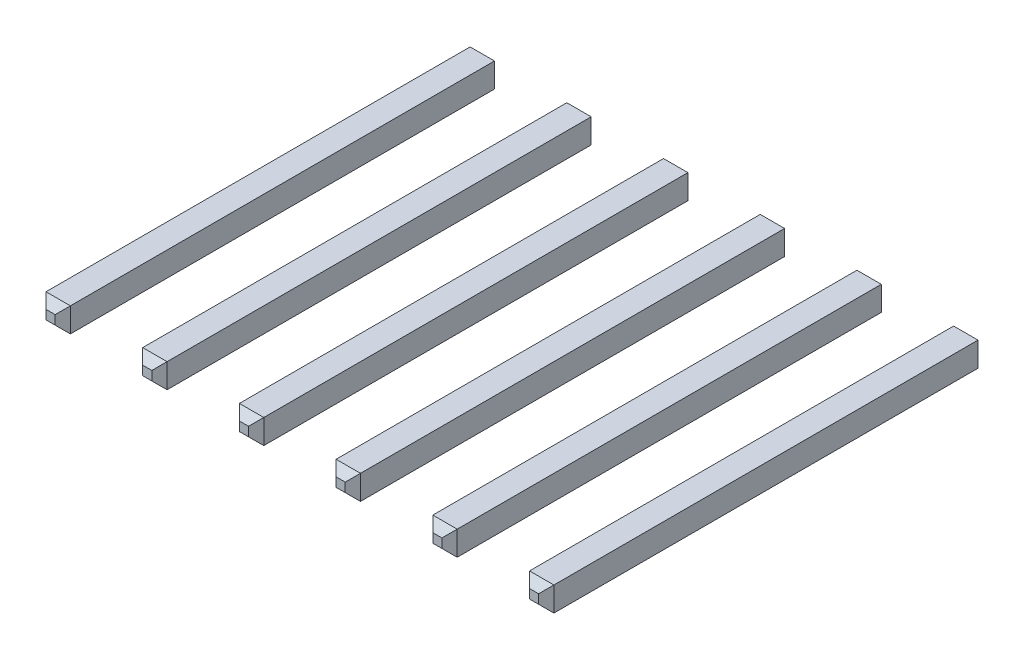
ISO-10303-21;
HEADER;
FILE_DESCRIPTION(('STEP AP214'),'2;1');
FILE_NAME('part.step','',(''),(''),'','','');
FILE_SCHEMA(('AUTOMOTIVE_DESIGN { 1 0 10303 214 1 1 1 1 }'));
ENDSEC;
DATA;
#1=APPLICATION_CONTEXT('core data for automotive mechanical design processes');
#2=APPLICATION_PROTOCOL_DEFINITION('international standard','automotive_design',2000,#1);
#3=PRODUCT_CONTEXT('',#1,'mechanical');
#4=PRODUCT('Part','Part','',(#3));
#5=PRODUCT_RELATED_PRODUCT_CATEGORY('part','',(#4));
#6=PRODUCT_DEFINITION_FORMATION('','',#4);
#7=PRODUCT_DEFINITION_CONTEXT('part definition',#1,'design');
#8=PRODUCT_DEFINITION('design','',#6,#7);
#9=PRODUCT_DEFINITION_SHAPE('','',#8);
#10=(LENGTH_UNIT() NAMED_UNIT(*) SI_UNIT(.MILLI.,.METRE.));
#11=(NAMED_UNIT(*) PLANE_ANGLE_UNIT() SI_UNIT($,.RADIAN.));
#12=(NAMED_UNIT(*) SI_UNIT($,.STERADIAN.) SOLID_ANGLE_UNIT());
#13=UNCERTAINTY_MEASURE_WITH_UNIT(LENGTH_MEASURE(1.E-05),#10,'distance_accuracy_value','');
#14=(GEOMETRIC_REPRESENTATION_CONTEXT(3) GLOBAL_UNCERTAINTY_ASSIGNED_CONTEXT((#13)) GLOBAL_UNIT_ASSIGNED_CONTEXT((#10,
#11,#12)) REPRESENTATION_CONTEXT('',''));
#15=CARTESIAN_POINT('',(0.,0.,0.));
#16=DIRECTION('',(0.,0.,1.));
#17=DIRECTION('',(1.,0.,0.));
#18=AXIS2_PLACEMENT_3D('',#15,#16,#17);
#19=CARTESIAN_POINT('',(13.019999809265,-0.21999999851,8.439999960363));
#20=DIRECTION('',(0.,-0.707106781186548,0.707106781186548));
#21=DIRECTION('',(0.,-0.707106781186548,-0.707106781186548));
#22=AXIS2_PLACEMENT_3D('',#19,#20,#21);
#23=PLANE('',#22);
#24=DIRECTION('',(1.,0.,0.));
#25=VECTOR('',#24,1.);
#26=CARTESIAN_POINT('',(13.019999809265,-0.32,8.339999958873));
#27=LINE('',#26,#25);
#28=CARTESIAN_POINT('',(13.019999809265,-0.32,8.339999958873));
#29=VERTEX_POINT('',#28);
#30=CARTESIAN_POINT('',(12.379999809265,-0.32,8.339999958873));
#31=VERTEX_POINT('',#30);
#32=EDGE_CURVE('P0_E105',#29,#31,#27,.F.);
#33=ORIENTED_EDGE('',*,*,#32,.F.);
#34=DIRECTION('',(0.577350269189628,-0.577350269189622,-0.577350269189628));
#35=VECTOR('',#34,1.);
#36=CARTESIAN_POINT('',(12.819999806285,-0.11999999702,8.539999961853));
#37=LINE('',#36,#35);
#38=CARTESIAN_POINT('',(12.819999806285,-0.11999999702,8.539999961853));
#39=VERTEX_POINT('',#38);
#40=EDGE_CURVE('P0_E86',#39,#29,#37,.T.);
#41=ORIENTED_EDGE('',*,*,#40,.F.);
#42=DIRECTION('',(1.,0.,0.));
#43=VECTOR('',#42,1.);
#44=CARTESIAN_POINT('',(12.379999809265,-0.11999999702,8.539999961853));
#45=LINE('',#44,#43);
#46=CARTESIAN_POINT('',(12.579999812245,-0.11999999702,8.539999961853));
#47=VERTEX_POINT('',#46);
#48=EDGE_CURVE('P0_E20',#47,#39,#45,.T.);
#49=ORIENTED_EDGE('',*,*,#48,.F.);
#50=DIRECTION('',(0.577350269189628,0.577350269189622,0.577350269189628));
#51=VECTOR('',#50,1.);
#52=CARTESIAN_POINT('',(12.379999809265,-0.32,8.339999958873));
#53=LINE('',#52,#51);
#54=EDGE_CURVE('P0_E83',#31,#47,#53,.T.);
#55=ORIENTED_EDGE('',*,*,#54,.F.);
#56=EDGE_LOOP('',(#33,#41,#49,#55));
#57=FACE_BOUND('',#56,.T.);
#58=ADVANCED_FACE('P0_F17',(#57),#23,.T.);
#59=CARTESIAN_POINT('',(13.019999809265,-0.21999999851,-2.89999999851));
#60=DIRECTION('',(0.,0.707106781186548,0.707106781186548));
#61=DIRECTION('',(0.,-0.707106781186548,0.707106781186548));
#62=AXIS2_PLACEMENT_3D('',#59,#60,#61);
#63=PLANE('',#62);
#64=DIRECTION('',(1.,0.,0.));
#65=VECTOR('',#64,1.);
#66=CARTESIAN_POINT('',(13.019999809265,-0.32,-2.79999999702));
#67=LINE('',#66,#65);
#68=CARTESIAN_POINT('',(12.379999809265,-0.32,-2.79999999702));
#69=VERTEX_POINT('',#68);
#70=CARTESIAN_POINT('',(13.019999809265,-0.32,-2.79999999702));
#71=VERTEX_POINT('',#70);
#72=EDGE_CURVE('P0_E107',#69,#71,#67,.T.);
#73=ORIENTED_EDGE('',*,*,#72,.F.);
#74=DIRECTION('',(0.577350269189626,0.577350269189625,-0.577350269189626));
#75=VECTOR('',#74,1.);
#76=CARTESIAN_POINT('',(12.379999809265,-0.32,-2.79999999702));
#77=LINE('',#76,#75);
#78=CARTESIAN_POINT('',(12.579999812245,-0.11999999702,-3.));
#79=VERTEX_POINT('',#78);
#80=EDGE_CURVE('P0_E119',#69,#79,#77,.T.);
#81=ORIENTED_EDGE('',*,*,#80,.T.);
#82=DIRECTION('',(1.,0.,0.));
#83=VECTOR('',#82,1.);
#84=CARTESIAN_POINT('',(12.379999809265,-0.11999999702,-3.));
#85=LINE('',#84,#83);
#86=CARTESIAN_POINT('',(12.819999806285,-0.11999999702,-3.));
#87=VERTEX_POINT('',#86);
#88=EDGE_CURVE('P0_E110',#79,#87,#85,.T.);
#89=ORIENTED_EDGE('',*,*,#88,.T.);
#90=DIRECTION('',(0.577350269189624,-0.577350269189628,0.577350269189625));
#91=VECTOR('',#90,1.);
#92=CARTESIAN_POINT('',(12.819999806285,-0.11999999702,-3.));
#93=LINE('',#92,#91);
#94=EDGE_CURVE('P0_E115',#87,#71,#93,.T.);
#95=ORIENTED_EDGE('',*,*,#94,.T.);
#96=EDGE_LOOP('',(#73,#81,#89,#95));
#97=FACE_BOUND('',#96,.T.);
#98=ADVANCED_FACE('P0_F184',(#97),#63,.F.);
#99=CARTESIAN_POINT('',(12.379999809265,0.32,8.539999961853));
#100=DIRECTION('',(0.,0.,1.));
#101=DIRECTION('',(1.,0.,0.));
#102=AXIS2_PLACEMENT_3D('',#99,#100,#101);
#103=PLANE('',#102);
#104=DIRECTION('',(0.,1.,0.));
#105=VECTOR('',#104,1.);
#106=CARTESIAN_POINT('',(12.819999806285,0.32,8.539999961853));
#107=LINE('',#106,#105);
#108=CARTESIAN_POINT('',(12.819999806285,0.11999999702,8.539999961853));
#109=VERTEX_POINT('',#108);
#110=EDGE_CURVE('P0_E100',#109,#39,#107,.F.);
#111=ORIENTED_EDGE('',*,*,#110,.F.);
#112=DIRECTION('',(1.,0.,0.));
#113=VECTOR('',#112,1.);
#114=CARTESIAN_POINT('',(12.379999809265,0.11999999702,8.539999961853));
#115=LINE('',#114,#113);
#116=CARTESIAN_POINT('',(12.579999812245,0.11999999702,8.539999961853));
#117=VERTEX_POINT('',#116);
#118=EDGE_CURVE('P0_E92',#117,#109,#115,.T.);
#119=ORIENTED_EDGE('',*,*,#118,.F.);
#120=DIRECTION('',(0.,1.,0.));
#121=VECTOR('',#120,1.);
#122=CARTESIAN_POINT('',(12.579999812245,-0.32,8.539999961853));
#123=LINE('',#122,#121);
#124=EDGE_CURVE('P0_E88',#47,#117,#123,.T.);
#125=ORIENTED_EDGE('',*,*,#124,.F.);
#126=ORIENTED_EDGE('',*,*,#48,.T.);
#127=EDGE_LOOP('',(#111,#119,#125,#126));
#128=FACE_BOUND('',#127,.T.);
#129=ADVANCED_FACE('P0_F90',(#128),#103,.T.);
#130=CARTESIAN_POINT('',(12.479999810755,-0.32,8.439999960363));
#131=DIRECTION('',(-0.707106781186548,0.,0.707106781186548));
#132=DIRECTION('',(0.707106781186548,0.,0.707106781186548));
#133=AXIS2_PLACEMENT_3D('',#130,#131,#132);
#134=PLANE('',#133);
#135=DIRECTION('',(0.,1.,0.));
#136=VECTOR('',#135,1.);
#137=CARTESIAN_POINT('',(12.379999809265,-0.32,8.339999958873));
#138=LINE('',#137,#136);
#139=CARTESIAN_POINT('',(12.379999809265,0.32,8.339999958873));
#140=VERTEX_POINT('',#139);
#141=EDGE_CURVE('P0_E98',#31,#140,#138,.T.);
#142=ORIENTED_EDGE('',*,*,#141,.F.);
#143=ORIENTED_EDGE('',*,*,#54,.T.);
#144=ORIENTED_EDGE('',*,*,#124,.T.);
#145=DIRECTION('',(0.577350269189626,-0.577350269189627,0.577350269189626));
#146=VECTOR('',#145,1.);
#147=CARTESIAN_POINT('',(12.379999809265,0.320000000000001,8.339999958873));
#148=LINE('',#147,#146);
#149=EDGE_CURVE('P0_E132',#140,#117,#148,.T.);
#150=ORIENTED_EDGE('',*,*,#149,.F.);
#151=EDGE_LOOP('',(#142,#143,#144,#150));
#152=FACE_BOUND('',#151,.T.);
#153=ADVANCED_FACE('P0_F96',(#152),#134,.T.);
#154=CARTESIAN_POINT('',(12.919999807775,0.32,8.439999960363));
#155=DIRECTION('',(0.707106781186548,0.,0.707106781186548));
#156=DIRECTION('',(0.707106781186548,0.,-0.707106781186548));
#157=AXIS2_PLACEMENT_3D('',#154,#155,#156);
#158=PLANE('',#157);
#159=DIRECTION('',(0.,1.,0.));
#160=VECTOR('',#159,1.);
#161=CARTESIAN_POINT('',(13.019999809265,0.32,8.339999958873));
#162=LINE('',#161,#160);
#163=CARTESIAN_POINT('',(13.019999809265,0.32,8.339999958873));
#164=VERTEX_POINT('',#163);
#165=EDGE_CURVE('P0_E134',#164,#29,#162,.F.);
#166=ORIENTED_EDGE('',*,*,#165,.F.);
#167=DIRECTION('',(0.577350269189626,0.577350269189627,-0.577350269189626));
#168=VECTOR('',#167,1.);
#169=CARTESIAN_POINT('',(12.819999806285,0.11999999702,8.539999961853));
#170=LINE('',#169,#168);
#171=EDGE_CURVE('P0_E129',#109,#164,#170,.T.);
#172=ORIENTED_EDGE('',*,*,#171,.F.);
#173=ORIENTED_EDGE('',*,*,#110,.T.);
#174=ORIENTED_EDGE('',*,*,#40,.T.);
#175=EDGE_LOOP('',(#166,#172,#173,#174));
#176=FACE_BOUND('',#175,.T.);
#177=ADVANCED_FACE('P0_F180',(#176),#158,.T.);
#178=CARTESIAN_POINT('',(13.019999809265,-0.32,-3.));
#179=DIRECTION('',(0.,-1.,0.));
#180=DIRECTION('',(0.,0.,-1.));
#181=AXIS2_PLACEMENT_3D('',#178,#179,#180);
#182=PLANE('',#181);
#183=DIRECTION('',(0.,0.,1.));
#184=VECTOR('',#183,1.);
#185=CARTESIAN_POINT('',(12.379999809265,-0.32,-3.));
#186=LINE('',#185,#184);
#187=EDGE_CURVE('P0_E122',#69,#31,#186,.T.);
#188=ORIENTED_EDGE('',*,*,#187,.F.);
#189=ORIENTED_EDGE('',*,*,#72,.T.);
#190=DIRECTION('',(0.,0.,-1.));
#191=VECTOR('',#190,1.);
#192=CARTESIAN_POINT('',(13.019999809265,-0.32,-3.));
#193=LINE('',#192,#191);
#194=EDGE_CURVE('P0_E137',#29,#71,#193,.T.);
#195=ORIENTED_EDGE('',*,*,#194,.F.);
#196=ORIENTED_EDGE('',*,*,#32,.T.);
#197=EDGE_LOOP('',(#188,#189,#195,#196));
#198=FACE_BOUND('',#197,.T.);
#199=ADVANCED_FACE('P0_F182',(#198),#182,.T.);
#200=CARTESIAN_POINT('',(12.379999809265,0.32,-3.));
#201=DIRECTION('',(0.,0.,1.));
#202=DIRECTION('',(1.,0.,0.));
#203=AXIS2_PLACEMENT_3D('',#200,#201,#202);
#204=PLANE('',#203);
#205=DIRECTION('',(1.,0.,0.));
#206=VECTOR('',#205,1.);
#207=CARTESIAN_POINT('',(12.379999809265,0.11999999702,-3.));
#208=LINE('',#207,#206);
#209=CARTESIAN_POINT('',(12.579999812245,0.11999999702,-3.));
#210=VERTEX_POINT('',#209);
#211=CARTESIAN_POINT('',(12.819999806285,0.11999999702,-3.));
#212=VERTEX_POINT('',#211);
#213=EDGE_CURVE('P0_E142',#210,#212,#208,.T.);
#214=ORIENTED_EDGE('',*,*,#213,.T.);
#215=DIRECTION('',(0.,1.,0.));
#216=VECTOR('',#215,1.);
#217=CARTESIAN_POINT('',(12.819999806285,0.32,-3.));
#218=LINE('',#217,#216);
#219=EDGE_CURVE('P0_E112',#212,#87,#218,.F.);
#220=ORIENTED_EDGE('',*,*,#219,.T.);
#221=ORIENTED_EDGE('',*,*,#88,.F.);
#222=DIRECTION('',(0.,1.,0.));
#223=VECTOR('',#222,1.);
#224=CARTESIAN_POINT('',(12.579999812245,-0.32,-3.));
#225=LINE('',#224,#223);
#226=EDGE_CURVE('P0_E117',#79,#210,#225,.T.);
#227=ORIENTED_EDGE('',*,*,#226,.T.);
#228=EDGE_LOOP('',(#214,#220,#221,#227));
#229=FACE_BOUND('',#228,.T.);
#230=ADVANCED_FACE('P0_F187',(#229),#204,.F.);
#231=CARTESIAN_POINT('',(12.919999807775,0.32,-2.89999999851));
#232=DIRECTION('',(-0.707106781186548,0.,0.707106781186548));
#233=DIRECTION('',(0.707106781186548,0.,0.707106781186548));
#234=AXIS2_PLACEMENT_3D('',#231,#232,#233);
#235=PLANE('',#234);
#236=DIRECTION('',(0.,1.,0.));
#237=VECTOR('',#236,1.);
#238=CARTESIAN_POINT('',(13.019999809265,0.32,-2.79999999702));
#239=LINE('',#238,#237);
#240=CARTESIAN_POINT('',(13.019999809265,0.32,-2.79999999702));
#241=VERTEX_POINT('',#240);
#242=EDGE_CURVE('P0_E140',#71,#241,#239,.T.);
#243=ORIENTED_EDGE('',*,*,#242,.F.);
#244=ORIENTED_EDGE('',*,*,#94,.F.);
#245=ORIENTED_EDGE('',*,*,#219,.F.);
#246=DIRECTION('',(0.577350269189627,0.577350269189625,0.577350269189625));
#247=VECTOR('',#246,1.);
#248=CARTESIAN_POINT('',(12.819999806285,0.11999999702,-3.));
#249=LINE('',#248,#247);
#250=EDGE_CURVE('P0_E35',#212,#241,#249,.T.);
#251=ORIENTED_EDGE('',*,*,#250,.T.);
#252=EDGE_LOOP('',(#243,#244,#245,#251));
#253=FACE_BOUND('',#252,.T.);
#254=ADVANCED_FACE('P0_F185',(#253),#235,.F.);
#255=CARTESIAN_POINT('',(12.479999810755,-0.32,-2.89999999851));
#256=DIRECTION('',(0.707106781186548,0.,0.707106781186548));
#257=DIRECTION('',(0.707106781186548,0.,-0.707106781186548));
#258=AXIS2_PLACEMENT_3D('',#255,#256,#257);
#259=PLANE('',#258);
#260=DIRECTION('',(0.,1.,0.));
#261=VECTOR('',#260,1.);
#262=CARTESIAN_POINT('',(12.379999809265,-0.32,-2.79999999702));
#263=LINE('',#262,#261);
#264=CARTESIAN_POINT('',(12.379999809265,0.32,-2.79999999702));
#265=VERTEX_POINT('',#264);
#266=EDGE_CURVE('P0_E125',#265,#69,#263,.F.);
#267=ORIENTED_EDGE('',*,*,#266,.F.);
#268=DIRECTION('',(0.577350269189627,-0.577350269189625,-0.577350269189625));
#269=VECTOR('',#268,1.);
#270=CARTESIAN_POINT('',(12.379999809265,0.32,-2.79999999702));
#271=LINE('',#270,#269);
#272=EDGE_CURVE('P0_E145',#265,#210,#271,.T.);
#273=ORIENTED_EDGE('',*,*,#272,.T.);
#274=ORIENTED_EDGE('',*,*,#226,.F.);
#275=ORIENTED_EDGE('',*,*,#80,.F.);
#276=EDGE_LOOP('',(#267,#273,#274,#275));
#277=FACE_BOUND('',#276,.T.);
#278=ADVANCED_FACE('P0_F170',(#277),#259,.F.);
#279=CARTESIAN_POINT('',(12.379999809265,-0.32,-3.));
#280=DIRECTION('',(-1.,0.,0.));
#281=DIRECTION('',(0.,0.,1.));
#282=AXIS2_PLACEMENT_3D('',#279,#280,#281);
#283=PLANE('',#282);
#284=DIRECTION('',(0.,0.,1.));
#285=VECTOR('',#284,1.);
#286=CARTESIAN_POINT('',(12.379999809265,0.32,-3.));
#287=LINE('',#286,#285);
#288=EDGE_CURVE('P0_E148',#265,#140,#287,.T.);
#289=ORIENTED_EDGE('',*,*,#288,.F.);
#290=ORIENTED_EDGE('',*,*,#266,.T.);
#291=ORIENTED_EDGE('',*,*,#187,.T.);
#292=ORIENTED_EDGE('',*,*,#141,.T.);
#293=EDGE_LOOP('',(#289,#290,#291,#292));
#294=FACE_BOUND('',#293,.T.);
#295=ADVANCED_FACE('P0_F174',(#294),#283,.T.);
#296=CARTESIAN_POINT('',(12.379999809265,0.21999999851,8.439999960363));
#297=DIRECTION('',(0.,0.707106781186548,0.707106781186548));
#298=DIRECTION('',(0.,-0.707106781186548,0.707106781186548));
#299=AXIS2_PLACEMENT_3D('',#296,#297,#298);
#300=PLANE('',#299);
#301=DIRECTION('',(1.,0.,0.));
#302=VECTOR('',#301,1.);
#303=CARTESIAN_POINT('',(12.379999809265,0.32,8.339999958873));
#304=LINE('',#303,#302);
#305=EDGE_CURVE('P0_E151',#140,#164,#304,.T.);
#306=ORIENTED_EDGE('',*,*,#305,.F.);
#307=ORIENTED_EDGE('',*,*,#149,.T.);
#308=ORIENTED_EDGE('',*,*,#118,.T.);
#309=ORIENTED_EDGE('',*,*,#171,.T.);
#310=EDGE_LOOP('',(#306,#307,#308,#309));
#311=FACE_BOUND('',#310,.T.);
#312=ADVANCED_FACE('P0_F177',(#311),#300,.T.);
#313=CARTESIAN_POINT('',(13.019999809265,0.32,-3.));
#314=DIRECTION('',(1.,0.,0.));
#315=DIRECTION('',(0.,0.,-1.));
#316=AXIS2_PLACEMENT_3D('',#313,#314,#315);
#317=PLANE('',#316);
#318=ORIENTED_EDGE('',*,*,#194,.T.);
#319=ORIENTED_EDGE('',*,*,#242,.T.);
#320=DIRECTION('',(0.,0.,1.));
#321=VECTOR('',#320,1.);
#322=CARTESIAN_POINT('',(13.019999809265,0.32,-3.));
#323=LINE('',#322,#321);
#324=EDGE_CURVE('P0_E26',#164,#241,#323,.F.);
#325=ORIENTED_EDGE('',*,*,#324,.F.);
#326=ORIENTED_EDGE('',*,*,#165,.T.);
#327=EDGE_LOOP('',(#318,#319,#325,#326));
#328=FACE_BOUND('',#327,.T.);
#329=ADVANCED_FACE('P0_F161',(#328),#317,.T.);
#330=CARTESIAN_POINT('',(12.379999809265,0.21999999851,-2.89999999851));
#331=DIRECTION('',(0.,-0.707106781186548,0.707106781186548));
#332=DIRECTION('',(0.,-0.707106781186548,-0.707106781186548));
#333=AXIS2_PLACEMENT_3D('',#330,#331,#332);
#334=PLANE('',#333);
#335=DIRECTION('',(1.,0.,0.));
#336=VECTOR('',#335,1.);
#337=CARTESIAN_POINT('',(12.379999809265,0.32,-2.79999999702));
#338=LINE('',#337,#336);
#339=EDGE_CURVE('P0_E11',#241,#265,#338,.F.);
#340=ORIENTED_EDGE('',*,*,#339,.F.);
#341=ORIENTED_EDGE('',*,*,#250,.F.);
#342=ORIENTED_EDGE('',*,*,#213,.F.);
#343=ORIENTED_EDGE('',*,*,#272,.F.);
#344=EDGE_LOOP('',(#340,#341,#342,#343));
#345=FACE_BOUND('',#344,.T.);
#346=ADVANCED_FACE('P0_F166',(#345),#334,.F.);
#347=CARTESIAN_POINT('',(12.379999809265,0.32,-3.));
#348=DIRECTION('',(0.,1.,0.));
#349=DIRECTION('',(0.,0.,1.));
#350=AXIS2_PLACEMENT_3D('',#347,#348,#349);
#351=PLANE('',#350);
#352=ORIENTED_EDGE('',*,*,#324,.T.);
#353=ORIENTED_EDGE('',*,*,#339,.T.);
#354=ORIENTED_EDGE('',*,*,#288,.T.);
#355=ORIENTED_EDGE('',*,*,#305,.T.);
#356=EDGE_LOOP('',(#352,#353,#354,#355));
#357=FACE_BOUND('',#356,.T.);
#358=ADVANCED_FACE('P0_F157',(#357),#351,.T.);
#359=CLOSED_SHELL('',(#58,#98,#129,#153,#177,#199,#230,#254,#278,#295,#312,#329,#346,#358));
#360=MANIFOLD_SOLID_BREP('P0_B1',#359);
#361=CARTESIAN_POINT('',(7.839999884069,0.32,8.439999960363));
#362=DIRECTION('',(0.707106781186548,0.,0.707106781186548));
#363=DIRECTION('',(0.707106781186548,0.,-0.707106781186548));
#364=AXIS2_PLACEMENT_3D('',#361,#362,#363);
#365=PLANE('',#364);
#366=DIRECTION('',(0.,1.,0.));
#367=VECTOR('',#366,1.);
#368=CARTESIAN_POINT('',(7.939999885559,0.32,8.339999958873));
#369=LINE('',#368,#367);
#370=CARTESIAN_POINT('',(7.939999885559,0.32,8.339999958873));
#371=VERTEX_POINT('',#370);
#372=CARTESIAN_POINT('',(7.939999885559,-0.32,8.339999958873));
#373=VERTEX_POINT('',#372);
#374=EDGE_CURVE('P1_E105',#371,#373,#369,.F.);
#375=ORIENTED_EDGE('',*,*,#374,.F.);
#376=DIRECTION('',(0.577350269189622,0.577350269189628,-0.577350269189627));
#377=VECTOR('',#376,1.);
#378=CARTESIAN_POINT('',(7.739999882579,0.11999999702,8.539999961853));
#379=LINE('',#378,#377);
#380=CARTESIAN_POINT('',(7.739999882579,0.11999999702,8.539999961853));
#381=VERTEX_POINT('',#380);
#382=EDGE_CURVE('P1_E86',#381,#371,#379,.T.);
#383=ORIENTED_EDGE('',*,*,#382,.F.);
#384=DIRECTION('',(0.,1.,0.));
#385=VECTOR('',#384,1.);
#386=CARTESIAN_POINT('',(7.739999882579,0.32,8.539999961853));
#387=LINE('',#386,#385);
#388=CARTESIAN_POINT('',(7.739999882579,-0.11999999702,8.539999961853));
#389=VERTEX_POINT('',#388);
#390=EDGE_CURVE('P1_E20',#389,#381,#387,.T.);
#391=ORIENTED_EDGE('',*,*,#390,.F.);
#392=DIRECTION('',(-0.577350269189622,0.577350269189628,0.577350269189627));
#393=VECTOR('',#392,1.);
#394=CARTESIAN_POINT('',(7.939999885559,-0.320000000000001,8.339999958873));
#395=LINE('',#394,#393);
#396=EDGE_CURVE('P1_E83',#373,#389,#395,.T.);
#397=ORIENTED_EDGE('',*,*,#396,.F.);
#398=EDGE_LOOP('',(#375,#383,#391,#397));
#399=FACE_BOUND('',#398,.T.);
#400=ADVANCED_FACE('P1_F17',(#399),#365,.T.);
#401=CARTESIAN_POINT('',(7.839999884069,0.32,-2.89999999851));
#402=DIRECTION('',(-0.707106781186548,0.,0.707106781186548));
#403=DIRECTION('',(0.707106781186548,0.,0.707106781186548));
#404=AXIS2_PLACEMENT_3D('',#401,#402,#403);
#405=PLANE('',#404);
#406=DIRECTION('',(0.,1.,0.));
#407=VECTOR('',#406,1.);
#408=CARTESIAN_POINT('',(7.939999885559,0.32,-2.79999999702));
#409=LINE('',#408,#407);
#410=CARTESIAN_POINT('',(7.939999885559,-0.32,-2.79999999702));
#411=VERTEX_POINT('',#410);
#412=CARTESIAN_POINT('',(7.939999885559,0.32,-2.79999999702));
#413=VERTEX_POINT('',#412);
#414=EDGE_CURVE('P1_E107',#411,#413,#409,.T.);
#415=ORIENTED_EDGE('',*,*,#414,.F.);
#416=DIRECTION('',(-0.577350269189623,0.577350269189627,-0.577350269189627));
#417=VECTOR('',#416,1.);
#418=CARTESIAN_POINT('',(7.939999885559,-0.32,-2.79999999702));
#419=LINE('',#418,#417);
#420=CARTESIAN_POINT('',(7.739999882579,-0.11999999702,-3.));
#421=VERTEX_POINT('',#420);
#422=EDGE_CURVE('P1_E119',#411,#421,#419,.T.);
#423=ORIENTED_EDGE('',*,*,#422,.T.);
#424=DIRECTION('',(0.,1.,0.));
#425=VECTOR('',#424,1.);
#426=CARTESIAN_POINT('',(7.739999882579,0.32,-3.));
#427=LINE('',#426,#425);
#428=CARTESIAN_POINT('',(7.739999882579,0.11999999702,-3.));
#429=VERTEX_POINT('',#428);
#430=EDGE_CURVE('P1_E110',#421,#429,#427,.T.);
#431=ORIENTED_EDGE('',*,*,#430,.T.);
#432=DIRECTION('',(0.577350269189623,0.577350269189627,0.577350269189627));
#433=VECTOR('',#432,1.);
#434=CARTESIAN_POINT('',(7.739999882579,0.11999999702,-3.));
#435=LINE('',#434,#433);
#436=EDGE_CURVE('P1_E115',#429,#413,#435,.T.);
#437=ORIENTED_EDGE('',*,*,#436,.T.);
#438=EDGE_LOOP('',(#415,#423,#431,#437));
#439=FACE_BOUND('',#438,.T.);
#440=ADVANCED_FACE('P1_F184',(#439),#405,.F.);
#441=CARTESIAN_POINT('',(7.299999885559,0.32,8.539999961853));
#442=DIRECTION('',(0.,0.,1.));
#443=DIRECTION('',(1.,0.,0.));
#444=AXIS2_PLACEMENT_3D('',#441,#442,#443);
#445=PLANE('',#444);
#446=ORIENTED_EDGE('',*,*,#390,.T.);
#447=DIRECTION('',(1.,0.,0.));
#448=VECTOR('',#447,1.);
#449=CARTESIAN_POINT('',(7.299999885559,0.11999999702,8.539999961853));
#450=LINE('',#449,#448);
#451=CARTESIAN_POINT('',(7.499999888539,0.11999999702,8.539999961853));
#452=VERTEX_POINT('',#451);
#453=EDGE_CURVE('P1_E100',#452,#381,#450,.T.);
#454=ORIENTED_EDGE('',*,*,#453,.F.);
#455=DIRECTION('',(0.,1.,0.));
#456=VECTOR('',#455,1.);
#457=CARTESIAN_POINT('',(7.499999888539,-0.32,8.539999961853));
#458=LINE('',#457,#456);
#459=CARTESIAN_POINT('',(7.499999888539,-0.11999999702,8.539999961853));
#460=VERTEX_POINT('',#459);
#461=EDGE_CURVE('P1_E92',#460,#452,#458,.T.);
#462=ORIENTED_EDGE('',*,*,#461,.F.);
#463=DIRECTION('',(1.,0.,0.));
#464=VECTOR('',#463,1.);
#465=CARTESIAN_POINT('',(7.939999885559,-0.11999999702,8.539999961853));
#466=LINE('',#465,#464);
#467=EDGE_CURVE('P1_E88',#389,#460,#466,.F.);
#468=ORIENTED_EDGE('',*,*,#467,.F.);
#469=EDGE_LOOP('',(#446,#454,#462,#468));
#470=FACE_BOUND('',#469,.T.);
#471=ADVANCED_FACE('P1_F90',(#470),#445,.T.);
#472=CARTESIAN_POINT('',(7.939999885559,-0.21999999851,8.439999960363));
#473=DIRECTION('',(0.,-0.707106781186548,0.707106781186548));
#474=DIRECTION('',(0.,-0.707106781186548,-0.707106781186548));
#475=AXIS2_PLACEMENT_3D('',#472,#473,#474);
#476=PLANE('',#475);
#477=DIRECTION('',(1.,0.,0.));
#478=VECTOR('',#477,1.);
#479=CARTESIAN_POINT('',(7.939999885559,-0.32,8.339999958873));
#480=LINE('',#479,#478);
#481=CARTESIAN_POINT('',(7.299999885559,-0.32,8.339999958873));
#482=VERTEX_POINT('',#481);
#483=EDGE_CURVE('P1_E98',#373,#482,#480,.F.);
#484=ORIENTED_EDGE('',*,*,#483,.F.);
#485=ORIENTED_EDGE('',*,*,#396,.T.);
#486=ORIENTED_EDGE('',*,*,#467,.T.);
#487=DIRECTION('',(0.577350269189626,0.577350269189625,0.577350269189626));
#488=VECTOR('',#487,1.);
#489=CARTESIAN_POINT('',(7.299999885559,-0.32,8.339999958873));
#490=LINE('',#489,#488);
#491=EDGE_CURVE('P1_E132',#482,#460,#490,.T.);
#492=ORIENTED_EDGE('',*,*,#491,.F.);
#493=EDGE_LOOP('',(#484,#485,#486,#492));
#494=FACE_BOUND('',#493,.T.);
#495=ADVANCED_FACE('P1_F96',(#494),#476,.T.);
#496=CARTESIAN_POINT('',(7.299999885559,0.21999999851,8.439999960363));
#497=DIRECTION('',(0.,0.707106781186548,0.707106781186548));
#498=DIRECTION('',(0.,-0.707106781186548,0.707106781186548));
#499=AXIS2_PLACEMENT_3D('',#496,#497,#498);
#500=PLANE('',#499);
#501=DIRECTION('',(1.,0.,0.));
#502=VECTOR('',#501,1.);
#503=CARTESIAN_POINT('',(7.299999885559,0.32,8.339999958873));
#504=LINE('',#503,#502);
#505=CARTESIAN_POINT('',(7.299999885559,0.32,8.339999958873));
#506=VERTEX_POINT('',#505);
#507=EDGE_CURVE('P1_E134',#506,#371,#504,.T.);
#508=ORIENTED_EDGE('',*,*,#507,.F.);
#509=DIRECTION('',(-0.577350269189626,0.577350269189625,-0.577350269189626));
#510=VECTOR('',#509,1.);
#511=CARTESIAN_POINT('',(7.499999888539,0.11999999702,8.539999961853));
#512=LINE('',#511,#510);
#513=EDGE_CURVE('P1_E129',#452,#506,#512,.T.);
#514=ORIENTED_EDGE('',*,*,#513,.F.);
#515=ORIENTED_EDGE('',*,*,#453,.T.);
#516=ORIENTED_EDGE('',*,*,#382,.T.);
#517=EDGE_LOOP('',(#508,#514,#515,#516));
#518=FACE_BOUND('',#517,.T.);
#519=ADVANCED_FACE('P1_F180',(#518),#500,.T.);
#520=CARTESIAN_POINT('',(7.939999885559,0.32,-3.));
#521=DIRECTION('',(1.,0.,0.));
#522=DIRECTION('',(0.,0.,-1.));
#523=AXIS2_PLACEMENT_3D('',#520,#521,#522);
#524=PLANE('',#523);
#525=DIRECTION('',(0.,0.,-1.));
#526=VECTOR('',#525,1.);
#527=CARTESIAN_POINT('',(7.939999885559,-0.32,-3.));
#528=LINE('',#527,#526);
#529=EDGE_CURVE('P1_E122',#411,#373,#528,.F.);
#530=ORIENTED_EDGE('',*,*,#529,.F.);
#531=ORIENTED_EDGE('',*,*,#414,.T.);
#532=DIRECTION('',(0.,0.,1.));
#533=VECTOR('',#532,1.);
#534=CARTESIAN_POINT('',(7.939999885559,0.32,-3.));
#535=LINE('',#534,#533);
#536=EDGE_CURVE('P1_E137',#371,#413,#535,.F.);
#537=ORIENTED_EDGE('',*,*,#536,.F.);
#538=ORIENTED_EDGE('',*,*,#374,.T.);
#539=EDGE_LOOP('',(#530,#531,#537,#538));
#540=FACE_BOUND('',#539,.T.);
#541=ADVANCED_FACE('P1_F182',(#540),#524,.T.);
#542=CARTESIAN_POINT('',(7.299999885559,0.32,-3.));
#543=DIRECTION('',(0.,0.,1.));
#544=DIRECTION('',(1.,0.,0.));
#545=AXIS2_PLACEMENT_3D('',#542,#543,#544);
#546=PLANE('',#545);
#547=DIRECTION('',(1.,0.,0.));
#548=VECTOR('',#547,1.);
#549=CARTESIAN_POINT('',(7.299999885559,0.11999999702,-3.));
#550=LINE('',#549,#548);
#551=CARTESIAN_POINT('',(7.499999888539,0.11999999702,-3.));
#552=VERTEX_POINT('',#551);
#553=EDGE_CURVE('P1_E112',#552,#429,#550,.T.);
#554=ORIENTED_EDGE('',*,*,#553,.T.);
#555=ORIENTED_EDGE('',*,*,#430,.F.);
#556=DIRECTION('',(1.,0.,0.));
#557=VECTOR('',#556,1.);
#558=CARTESIAN_POINT('',(7.939999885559,-0.11999999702,-3.));
#559=LINE('',#558,#557);
#560=CARTESIAN_POINT('',(7.499999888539,-0.11999999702,-3.));
#561=VERTEX_POINT('',#560);
#562=EDGE_CURVE('P1_E117',#421,#561,#559,.F.);
#563=ORIENTED_EDGE('',*,*,#562,.T.);
#564=DIRECTION('',(0.,1.,0.));
#565=VECTOR('',#564,1.);
#566=CARTESIAN_POINT('',(7.499999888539,-0.32,-3.));
#567=LINE('',#566,#565);
#568=EDGE_CURVE('P1_E142',#561,#552,#567,.T.);
#569=ORIENTED_EDGE('',*,*,#568,.T.);
#570=EDGE_LOOP('',(#554,#555,#563,#569));
#571=FACE_BOUND('',#570,.T.);
#572=ADVANCED_FACE('P1_F187',(#571),#546,.F.);
#573=CARTESIAN_POINT('',(7.299999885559,0.21999999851,-2.89999999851));
#574=DIRECTION('',(0.,-0.707106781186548,0.707106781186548));
#575=DIRECTION('',(0.,-0.707106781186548,-0.707106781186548));
#576=AXIS2_PLACEMENT_3D('',#573,#574,#575);
#577=PLANE('',#576);
#578=DIRECTION('',(1.,0.,0.));
#579=VECTOR('',#578,1.);
#580=CARTESIAN_POINT('',(7.299999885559,0.32,-2.79999999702));
#581=LINE('',#580,#579);
#582=CARTESIAN_POINT('',(7.299999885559,0.32,-2.79999999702));
#583=VERTEX_POINT('',#582);
#584=EDGE_CURVE('P1_E140',#413,#583,#581,.F.);
#585=ORIENTED_EDGE('',*,*,#584,.F.);
#586=ORIENTED_EDGE('',*,*,#436,.F.);
#587=ORIENTED_EDGE('',*,*,#553,.F.);
#588=DIRECTION('',(-0.577350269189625,0.577350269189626,0.577350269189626));
#589=VECTOR('',#588,1.);
#590=CARTESIAN_POINT('',(7.499999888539,0.11999999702,-3.));
#591=LINE('',#590,#589);
#592=EDGE_CURVE('P1_E35',#552,#583,#591,.T.);
#593=ORIENTED_EDGE('',*,*,#592,.T.);
#594=EDGE_LOOP('',(#585,#586,#587,#593));
#595=FACE_BOUND('',#594,.T.);
#596=ADVANCED_FACE('P1_F185',(#595),#577,.F.);
#597=CARTESIAN_POINT('',(7.939999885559,-0.21999999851,-2.89999999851));
#598=DIRECTION('',(0.,0.707106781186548,0.707106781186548));
#599=DIRECTION('',(0.,-0.707106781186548,0.707106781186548));
#600=AXIS2_PLACEMENT_3D('',#597,#598,#599);
#601=PLANE('',#600);
#602=DIRECTION('',(1.,0.,0.));
#603=VECTOR('',#602,1.);
#604=CARTESIAN_POINT('',(7.939999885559,-0.32,-2.79999999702));
#605=LINE('',#604,#603);
#606=CARTESIAN_POINT('',(7.299999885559,-0.32,-2.79999999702));
#607=VERTEX_POINT('',#606);
#608=EDGE_CURVE('P1_E125',#607,#411,#605,.T.);
#609=ORIENTED_EDGE('',*,*,#608,.F.);
#610=DIRECTION('',(0.577350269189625,0.577350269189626,-0.577350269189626));
#611=VECTOR('',#610,1.);
#612=CARTESIAN_POINT('',(7.299999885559,-0.32,-2.79999999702));
#613=LINE('',#612,#611);
#614=EDGE_CURVE('P1_E145',#607,#561,#613,.T.);
#615=ORIENTED_EDGE('',*,*,#614,.T.);
#616=ORIENTED_EDGE('',*,*,#562,.F.);
#617=ORIENTED_EDGE('',*,*,#422,.F.);
#618=EDGE_LOOP('',(#609,#615,#616,#617));
#619=FACE_BOUND('',#618,.T.);
#620=ADVANCED_FACE('P1_F170',(#619),#601,.F.);
#621=CARTESIAN_POINT('',(7.939999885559,-0.32,-3.));
#622=DIRECTION('',(0.,-1.,0.));
#623=DIRECTION('',(0.,0.,-1.));
#624=AXIS2_PLACEMENT_3D('',#621,#622,#623);
#625=PLANE('',#624);
#626=DIRECTION('',(0.,0.,1.));
#627=VECTOR('',#626,1.);
#628=CARTESIAN_POINT('',(7.299999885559,-0.32,-3.));
#629=LINE('',#628,#627);
#630=EDGE_CURVE('P1_E148',#607,#482,#629,.T.);
#631=ORIENTED_EDGE('',*,*,#630,.F.);
#632=ORIENTED_EDGE('',*,*,#608,.T.);
#633=ORIENTED_EDGE('',*,*,#529,.T.);
#634=ORIENTED_EDGE('',*,*,#483,.T.);
#635=EDGE_LOOP('',(#631,#632,#633,#634));
#636=FACE_BOUND('',#635,.T.);
#637=ADVANCED_FACE('P1_F174',(#636),#625,.T.);
#638=CARTESIAN_POINT('',(7.399999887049,-0.32,8.439999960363));
#639=DIRECTION('',(-0.707106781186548,0.,0.707106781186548));
#640=DIRECTION('',(0.707106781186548,0.,0.707106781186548));
#641=AXIS2_PLACEMENT_3D('',#638,#639,#640);
#642=PLANE('',#641);
#643=DIRECTION('',(0.,1.,0.));
#644=VECTOR('',#643,1.);
#645=CARTESIAN_POINT('',(7.299999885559,-0.32,8.339999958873));
#646=LINE('',#645,#644);
#647=EDGE_CURVE('P1_E151',#482,#506,#646,.T.);
#648=ORIENTED_EDGE('',*,*,#647,.F.);
#649=ORIENTED_EDGE('',*,*,#491,.T.);
#650=ORIENTED_EDGE('',*,*,#461,.T.);
#651=ORIENTED_EDGE('',*,*,#513,.T.);
#652=EDGE_LOOP('',(#648,#649,#650,#651));
#653=FACE_BOUND('',#652,.T.);
#654=ADVANCED_FACE('P1_F177',(#653),#642,.T.);
#655=CARTESIAN_POINT('',(7.299999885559,0.32,-3.));
#656=DIRECTION('',(0.,1.,0.));
#657=DIRECTION('',(0.,0.,1.));
#658=AXIS2_PLACEMENT_3D('',#655,#656,#657);
#659=PLANE('',#658);
#660=ORIENTED_EDGE('',*,*,#536,.T.);
#661=ORIENTED_EDGE('',*,*,#584,.T.);
#662=DIRECTION('',(0.,0.,1.));
#663=VECTOR('',#662,1.);
#664=CARTESIAN_POINT('',(7.299999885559,0.32,-3.));
#665=LINE('',#664,#663);
#666=EDGE_CURVE('P1_E26',#506,#583,#665,.F.);
#667=ORIENTED_EDGE('',*,*,#666,.F.);
#668=ORIENTED_EDGE('',*,*,#507,.T.);
#669=EDGE_LOOP('',(#660,#661,#667,#668));
#670=FACE_BOUND('',#669,.T.);
#671=ADVANCED_FACE('P1_F161',(#670),#659,.T.);
#672=CARTESIAN_POINT('',(7.399999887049,-0.32,-2.89999999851));
#673=DIRECTION('',(0.707106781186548,0.,0.707106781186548));
#674=DIRECTION('',(0.707106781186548,0.,-0.707106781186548));
#675=AXIS2_PLACEMENT_3D('',#672,#673,#674);
#676=PLANE('',#675);
#677=DIRECTION('',(0.,1.,0.));
#678=VECTOR('',#677,1.);
#679=CARTESIAN_POINT('',(7.299999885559,-0.32,-2.79999999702));
#680=LINE('',#679,#678);
#681=EDGE_CURVE('P1_E11',#583,#607,#680,.F.);
#682=ORIENTED_EDGE('',*,*,#681,.F.);
#683=ORIENTED_EDGE('',*,*,#592,.F.);
#684=ORIENTED_EDGE('',*,*,#568,.F.);
#685=ORIENTED_EDGE('',*,*,#614,.F.);
#686=EDGE_LOOP('',(#682,#683,#684,#685));
#687=FACE_BOUND('',#686,.T.);
#688=ADVANCED_FACE('P1_F166',(#687),#676,.F.);
#689=CARTESIAN_POINT('',(7.299999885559,-0.32,-3.));
#690=DIRECTION('',(-1.,0.,0.));
#691=DIRECTION('',(0.,0.,1.));
#692=AXIS2_PLACEMENT_3D('',#689,#690,#691);
#693=PLANE('',#692);
#694=ORIENTED_EDGE('',*,*,#666,.T.);
#695=ORIENTED_EDGE('',*,*,#681,.T.);
#696=ORIENTED_EDGE('',*,*,#630,.T.);
#697=ORIENTED_EDGE('',*,*,#647,.T.);
#698=EDGE_LOOP('',(#694,#695,#696,#697));
#699=FACE_BOUND('',#698,.T.);
#700=ADVANCED_FACE('P1_F157',(#699),#693,.T.);
#701=CLOSED_SHELL('',(#400,#440,#471,#495,#519,#541,#572,#596,#620,#637,#654,#671,#688,#700));
#702=MANIFOLD_SOLID_BREP('P1_B1',#701);
#703=CARTESIAN_POINT('',(0.32,-0.21999999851,8.439999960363));
#704=DIRECTION('',(0.,-0.707106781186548,0.707106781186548));
#705=DIRECTION('',(0.,-0.707106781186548,-0.707106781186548));
#706=AXIS2_PLACEMENT_3D('',#703,#704,#705);
#707=PLANE('',#706);
#708=DIRECTION('',(1.,0.,0.));
#709=VECTOR('',#708,1.);
#710=CARTESIAN_POINT('',(0.32,-0.32,8.339999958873));
#711=LINE('',#710,#709);
#712=CARTESIAN_POINT('',(0.32,-0.32,8.339999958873));
#713=VERTEX_POINT('',#712);
#714=CARTESIAN_POINT('',(-0.32,-0.32,8.339999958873));
#715=VERTEX_POINT('',#714);
#716=EDGE_CURVE('P2_E105',#713,#715,#711,.F.);
#717=ORIENTED_EDGE('',*,*,#716,.F.);
#718=DIRECTION('',(0.577350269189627,-0.577350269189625,-0.577350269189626));
#719=VECTOR('',#718,1.);
#720=CARTESIAN_POINT('',(0.11999999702,-0.11999999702,8.539999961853));
#721=LINE('',#720,#719);
#722=CARTESIAN_POINT('',(0.11999999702,-0.11999999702,8.539999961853));
#723=VERTEX_POINT('',#722);
#724=EDGE_CURVE('P2_E86',#723,#713,#721,.T.);
#725=ORIENTED_EDGE('',*,*,#724,.F.);
#726=DIRECTION('',(1.,0.,0.));
#727=VECTOR('',#726,1.);
#728=CARTESIAN_POINT('',(-0.32,-0.11999999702,8.539999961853));
#729=LINE('',#728,#727);
#730=CARTESIAN_POINT('',(-0.11999999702,-0.11999999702,8.539999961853));
#731=VERTEX_POINT('',#730);
#732=EDGE_CURVE('P2_E20',#731,#723,#729,.T.);
#733=ORIENTED_EDGE('',*,*,#732,.F.);
#734=DIRECTION('',(0.577350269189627,0.577350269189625,0.577350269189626));
#735=VECTOR('',#734,1.);
#736=CARTESIAN_POINT('',(-0.320000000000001,-0.32,8.339999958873));
#737=LINE('',#736,#735);
#738=EDGE_CURVE('P2_E83',#715,#731,#737,.T.);
#739=ORIENTED_EDGE('',*,*,#738,.F.);
#740=EDGE_LOOP('',(#717,#725,#733,#739));
#741=FACE_BOUND('',#740,.T.);
#742=ADVANCED_FACE('P2_F17',(#741),#707,.T.);
#743=CARTESIAN_POINT('',(0.32,-0.21999999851,-2.89999999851));
#744=DIRECTION('',(0.,0.707106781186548,0.707106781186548));
#745=DIRECTION('',(0.,-0.707106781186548,0.707106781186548));
#746=AXIS2_PLACEMENT_3D('',#743,#744,#745);
#747=PLANE('',#746);
#748=DIRECTION('',(1.,0.,0.));
#749=VECTOR('',#748,1.);
#750=CARTESIAN_POINT('',(0.32,-0.32,-2.79999999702));
#751=LINE('',#750,#749);
#752=CARTESIAN_POINT('',(-0.32,-0.32,-2.79999999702));
#753=VERTEX_POINT('',#752);
#754=CARTESIAN_POINT('',(0.32,-0.32,-2.79999999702));
#755=VERTEX_POINT('',#754);
#756=EDGE_CURVE('P2_E107',#753,#755,#751,.T.);
#757=ORIENTED_EDGE('',*,*,#756,.F.);
#758=DIRECTION('',(0.577350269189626,0.577350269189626,-0.577350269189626));
#759=VECTOR('',#758,1.);
#760=CARTESIAN_POINT('',(-0.32,-0.32,-2.79999999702));
#761=LINE('',#760,#759);
#762=CARTESIAN_POINT('',(-0.11999999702,-0.11999999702,-3.));
#763=VERTEX_POINT('',#762);
#764=EDGE_CURVE('P2_E119',#753,#763,#761,.T.);
#765=ORIENTED_EDGE('',*,*,#764,.T.);
#766=DIRECTION('',(1.,0.,0.));
#767=VECTOR('',#766,1.);
#768=CARTESIAN_POINT('',(-0.32,-0.11999999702,-3.));
#769=LINE('',#768,#767);
#770=CARTESIAN_POINT('',(0.11999999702,-0.11999999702,-3.));
#771=VERTEX_POINT('',#770);
#772=EDGE_CURVE('P2_E110',#763,#771,#769,.T.);
#773=ORIENTED_EDGE('',*,*,#772,.T.);
#774=DIRECTION('',(0.577350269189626,-0.577350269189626,0.577350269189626));
#775=VECTOR('',#774,1.);
#776=CARTESIAN_POINT('',(0.11999999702,-0.11999999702,-3.));
#777=LINE('',#776,#775);
#778=EDGE_CURVE('P2_E115',#771,#755,#777,.T.);
#779=ORIENTED_EDGE('',*,*,#778,.T.);
#780=EDGE_LOOP('',(#757,#765,#773,#779));
#781=FACE_BOUND('',#780,.T.);
#782=ADVANCED_FACE('P2_F184',(#781),#747,.F.);
#783=CARTESIAN_POINT('',(-0.32,0.32,8.539999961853));
#784=DIRECTION('',(0.,0.,1.));
#785=DIRECTION('',(1.,0.,0.));
#786=AXIS2_PLACEMENT_3D('',#783,#784,#785);
#787=PLANE('',#786);
#788=DIRECTION('',(0.,1.,0.));
#789=VECTOR('',#788,1.);
#790=CARTESIAN_POINT('',(0.11999999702,0.32,8.539999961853));
#791=LINE('',#790,#789);
#792=CARTESIAN_POINT('',(0.11999999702,0.11999999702,8.539999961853));
#793=VERTEX_POINT('',#792);
#794=EDGE_CURVE('P2_E100',#793,#723,#791,.F.);
#795=ORIENTED_EDGE('',*,*,#794,.F.);
#796=DIRECTION('',(1.,0.,0.));
#797=VECTOR('',#796,1.);
#798=CARTESIAN_POINT('',(-0.32,0.11999999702,8.539999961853));
#799=LINE('',#798,#797);
#800=CARTESIAN_POINT('',(-0.11999999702,0.11999999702,8.539999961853));
#801=VERTEX_POINT('',#800);
#802=EDGE_CURVE('P2_E92',#801,#793,#799,.T.);
#803=ORIENTED_EDGE('',*,*,#802,.F.);
#804=DIRECTION('',(0.,1.,0.));
#805=VECTOR('',#804,1.);
#806=CARTESIAN_POINT('',(-0.11999999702,-0.32,8.539999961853));
#807=LINE('',#806,#805);
#808=EDGE_CURVE('P2_E88',#731,#801,#807,.T.);
#809=ORIENTED_EDGE('',*,*,#808,.F.);
#810=ORIENTED_EDGE('',*,*,#732,.T.);
#811=EDGE_LOOP('',(#795,#803,#809,#810));
#812=FACE_BOUND('',#811,.T.);
#813=ADVANCED_FACE('P2_F90',(#812),#787,.T.);
#814=CARTESIAN_POINT('',(-0.21999999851,-0.32,8.439999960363));
#815=DIRECTION('',(-0.707106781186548,0.,0.707106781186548));
#816=DIRECTION('',(0.707106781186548,0.,0.707106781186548));
#817=AXIS2_PLACEMENT_3D('',#814,#815,#816);
#818=PLANE('',#817);
#819=DIRECTION('',(0.,1.,0.));
#820=VECTOR('',#819,1.);
#821=CARTESIAN_POINT('',(-0.32,-0.32,8.339999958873));
#822=LINE('',#821,#820);
#823=CARTESIAN_POINT('',(-0.32,0.32,8.339999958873));
#824=VERTEX_POINT('',#823);
#825=EDGE_CURVE('P2_E98',#715,#824,#822,.T.);
#826=ORIENTED_EDGE('',*,*,#825,.F.);
#827=ORIENTED_EDGE('',*,*,#738,.T.);
#828=ORIENTED_EDGE('',*,*,#808,.T.);
#829=DIRECTION('',(0.577350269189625,-0.577350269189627,0.577350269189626));
#830=VECTOR('',#829,1.);
#831=CARTESIAN_POINT('',(-0.32,0.320000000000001,8.339999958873));
#832=LINE('',#831,#830);
#833=EDGE_CURVE('P2_E132',#824,#801,#832,.T.);
#834=ORIENTED_EDGE('',*,*,#833,.F.);
#835=EDGE_LOOP('',(#826,#827,#828,#834));
#836=FACE_BOUND('',#835,.T.);
#837=ADVANCED_FACE('P2_F96',(#836),#818,.T.);
#838=CARTESIAN_POINT('',(0.21999999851,0.32,8.439999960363));
#839=DIRECTION('',(0.707106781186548,0.,0.707106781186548));
#840=DIRECTION('',(0.707106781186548,0.,-0.707106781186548));
#841=AXIS2_PLACEMENT_3D('',#838,#839,#840);
#842=PLANE('',#841);
#843=DIRECTION('',(0.,1.,0.));
#844=VECTOR('',#843,1.);
#845=CARTESIAN_POINT('',(0.32,0.32,8.339999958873));
#846=LINE('',#845,#844);
#847=CARTESIAN_POINT('',(0.32,0.32,8.339999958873));
#848=VERTEX_POINT('',#847);
#849=EDGE_CURVE('P2_E134',#848,#713,#846,.F.);
#850=ORIENTED_EDGE('',*,*,#849,.F.);
#851=DIRECTION('',(0.577350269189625,0.577350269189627,-0.577350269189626));
#852=VECTOR('',#851,1.);
#853=CARTESIAN_POINT('',(0.11999999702,0.11999999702,8.539999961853));
#854=LINE('',#853,#852);
#855=EDGE_CURVE('P2_E129',#793,#848,#854,.T.);
#856=ORIENTED_EDGE('',*,*,#855,.F.);
#857=ORIENTED_EDGE('',*,*,#794,.T.);
#858=ORIENTED_EDGE('',*,*,#724,.T.);
#859=EDGE_LOOP('',(#850,#856,#857,#858));
#860=FACE_BOUND('',#859,.T.);
#861=ADVANCED_FACE('P2_F180',(#860),#842,.T.);
#862=CARTESIAN_POINT('',(0.32,-0.32,-3.));
#863=DIRECTION('',(0.,-1.,0.));
#864=DIRECTION('',(0.,0.,-1.));
#865=AXIS2_PLACEMENT_3D('',#862,#863,#864);
#866=PLANE('',#865);
#867=DIRECTION('',(0.,0.,1.));
#868=VECTOR('',#867,1.);
#869=CARTESIAN_POINT('',(-0.32,-0.32,-3.));
#870=LINE('',#869,#868);
#871=EDGE_CURVE('P2_E122',#753,#715,#870,.T.);
#872=ORIENTED_EDGE('',*,*,#871,.F.);
#873=ORIENTED_EDGE('',*,*,#756,.T.);
#874=DIRECTION('',(0.,0.,-1.));
#875=VECTOR('',#874,1.);
#876=CARTESIAN_POINT('',(0.32,-0.32,-3.));
#877=LINE('',#876,#875);
#878=EDGE_CURVE('P2_E137',#713,#755,#877,.T.);
#879=ORIENTED_EDGE('',*,*,#878,.F.);
#880=ORIENTED_EDGE('',*,*,#716,.T.);
#881=EDGE_LOOP('',(#872,#873,#879,#880));
#882=FACE_BOUND('',#881,.T.);
#883=ADVANCED_FACE('P2_F182',(#882),#866,.T.);
#884=CARTESIAN_POINT('',(-0.32,0.32,-3.));
#885=DIRECTION('',(0.,0.,1.));
#886=DIRECTION('',(1.,0.,0.));
#887=AXIS2_PLACEMENT_3D('',#884,#885,#886);
#888=PLANE('',#887);
#889=DIRECTION('',(1.,0.,0.));
#890=VECTOR('',#889,1.);
#891=CARTESIAN_POINT('',(-0.32,0.11999999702,-3.));
#892=LINE('',#891,#890);
#893=CARTESIAN_POINT('',(-0.11999999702,0.11999999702,-3.));
#894=VERTEX_POINT('',#893);
#895=CARTESIAN_POINT('',(0.11999999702,0.11999999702,-3.));
#896=VERTEX_POINT('',#895);
#897=EDGE_CURVE('P2_E142',#894,#896,#892,.T.);
#898=ORIENTED_EDGE('',*,*,#897,.T.);
#899=DIRECTION('',(0.,1.,0.));
#900=VECTOR('',#899,1.);
#901=CARTESIAN_POINT('',(0.11999999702,0.32,-3.));
#902=LINE('',#901,#900);
#903=EDGE_CURVE('P2_E112',#896,#771,#902,.F.);
#904=ORIENTED_EDGE('',*,*,#903,.T.);
#905=ORIENTED_EDGE('',*,*,#772,.F.);
#906=DIRECTION('',(0.,1.,0.));
#907=VECTOR('',#906,1.);
#908=CARTESIAN_POINT('',(-0.11999999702,-0.32,-3.));
#909=LINE('',#908,#907);
#910=EDGE_CURVE('P2_E117',#763,#894,#909,.T.);
#911=ORIENTED_EDGE('',*,*,#910,.T.);
#912=EDGE_LOOP('',(#898,#904,#905,#911));
#913=FACE_BOUND('',#912,.T.);
#914=ADVANCED_FACE('P2_F187',(#913),#888,.F.);
#915=CARTESIAN_POINT('',(0.21999999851,0.32,-2.89999999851));
#916=DIRECTION('',(-0.707106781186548,0.,0.707106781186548));
#917=DIRECTION('',(0.707106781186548,0.,0.707106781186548));
#918=AXIS2_PLACEMENT_3D('',#915,#916,#917);
#919=PLANE('',#918);
#920=DIRECTION('',(0.,1.,0.));
#921=VECTOR('',#920,1.);
#922=CARTESIAN_POINT('',(0.32,0.32,-2.79999999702));
#923=LINE('',#922,#921);
#924=CARTESIAN_POINT('',(0.32,0.32,-2.79999999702));
#925=VERTEX_POINT('',#924);
#926=EDGE_CURVE('P2_E140',#755,#925,#923,.T.);
#927=ORIENTED_EDGE('',*,*,#926,.F.);
#928=ORIENTED_EDGE('',*,*,#778,.F.);
#929=ORIENTED_EDGE('',*,*,#903,.F.);
#930=DIRECTION('',(0.577350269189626,0.577350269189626,0.577350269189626));
#931=VECTOR('',#930,1.);
#932=CARTESIAN_POINT('',(0.11999999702,0.11999999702,-3.));
#933=LINE('',#932,#931);
#934=EDGE_CURVE('P2_E35',#896,#925,#933,.T.);
#935=ORIENTED_EDGE('',*,*,#934,.T.);
#936=EDGE_LOOP('',(#927,#928,#929,#935));
#937=FACE_BOUND('',#936,.T.);
#938=ADVANCED_FACE('P2_F185',(#937),#919,.F.);
#939=CARTESIAN_POINT('',(-0.21999999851,-0.32,-2.89999999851));
#940=DIRECTION('',(0.707106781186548,0.,0.707106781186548));
#941=DIRECTION('',(0.707106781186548,0.,-0.707106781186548));
#942=AXIS2_PLACEMENT_3D('',#939,#940,#941);
#943=PLANE('',#942);
#944=DIRECTION('',(0.,1.,0.));
#945=VECTOR('',#944,1.);
#946=CARTESIAN_POINT('',(-0.32,-0.32,-2.79999999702));
#947=LINE('',#946,#945);
#948=CARTESIAN_POINT('',(-0.32,0.32,-2.79999999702));
#949=VERTEX_POINT('',#948);
#950=EDGE_CURVE('P2_E125',#949,#753,#947,.F.);
#951=ORIENTED_EDGE('',*,*,#950,.F.);
#952=DIRECTION('',(0.577350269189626,-0.577350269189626,-0.577350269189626));
#953=VECTOR('',#952,1.);
#954=CARTESIAN_POINT('',(-0.32,0.32,-2.79999999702));
#955=LINE('',#954,#953);
#956=EDGE_CURVE('P2_E145',#949,#894,#955,.T.);
#957=ORIENTED_EDGE('',*,*,#956,.T.);
#958=ORIENTED_EDGE('',*,*,#910,.F.);
#959=ORIENTED_EDGE('',*,*,#764,.F.);
#960=EDGE_LOOP('',(#951,#957,#958,#959));
#961=FACE_BOUND('',#960,.T.);
#962=ADVANCED_FACE('P2_F170',(#961),#943,.F.);
#963=CARTESIAN_POINT('',(-0.32,-0.32,-3.));
#964=DIRECTION('',(-1.,0.,0.));
#965=DIRECTION('',(0.,0.,1.));
#966=AXIS2_PLACEMENT_3D('',#963,#964,#965);
#967=PLANE('',#966);
#968=DIRECTION('',(0.,0.,1.));
#969=VECTOR('',#968,1.);
#970=CARTESIAN_POINT('',(-0.32,0.32,-3.));
#971=LINE('',#970,#969);
#972=EDGE_CURVE('P2_E148',#949,#824,#971,.T.);
#973=ORIENTED_EDGE('',*,*,#972,.F.);
#974=ORIENTED_EDGE('',*,*,#950,.T.);
#975=ORIENTED_EDGE('',*,*,#871,.T.);
#976=ORIENTED_EDGE('',*,*,#825,.T.);
#977=EDGE_LOOP('',(#973,#974,#975,#976));
#978=FACE_BOUND('',#977,.T.);
#979=ADVANCED_FACE('P2_F174',(#978),#967,.T.);
#980=CARTESIAN_POINT('',(-0.32,0.21999999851,8.439999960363));
#981=DIRECTION('',(0.,0.707106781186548,0.707106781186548));
#982=DIRECTION('',(0.,-0.707106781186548,0.707106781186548));
#983=AXIS2_PLACEMENT_3D('',#980,#981,#982);
#984=PLANE('',#983);
#985=DIRECTION('',(1.,0.,0.));
#986=VECTOR('',#985,1.);
#987=CARTESIAN_POINT('',(-0.32,0.32,8.339999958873));
#988=LINE('',#987,#986);
#989=EDGE_CURVE('P2_E151',#824,#848,#988,.T.);
#990=ORIENTED_EDGE('',*,*,#989,.F.);
#991=ORIENTED_EDGE('',*,*,#833,.T.);
#992=ORIENTED_EDGE('',*,*,#802,.T.);
#993=ORIENTED_EDGE('',*,*,#855,.T.);
#994=EDGE_LOOP('',(#990,#991,#992,#993));
#995=FACE_BOUND('',#994,.T.);
#996=ADVANCED_FACE('P2_F177',(#995),#984,.T.);
#997=CARTESIAN_POINT('',(0.32,0.32,-3.));
#998=DIRECTION('',(1.,0.,0.));
#999=DIRECTION('',(0.,0.,-1.));
#1000=AXIS2_PLACEMENT_3D('',#997,#998,#999);
#1001=PLANE('',#1000);
#1002=ORIENTED_EDGE('',*,*,#878,.T.);
#1003=ORIENTED_EDGE('',*,*,#926,.T.);
#1004=DIRECTION('',(0.,0.,1.));
#1005=VECTOR('',#1004,1.);
#1006=CARTESIAN_POINT('',(0.32,0.32,-3.));
#1007=LINE('',#1006,#1005);
#1008=EDGE_CURVE('P2_E26',#848,#925,#1007,.F.);
#1009=ORIENTED_EDGE('',*,*,#1008,.F.);
#1010=ORIENTED_EDGE('',*,*,#849,.T.);
#1011=EDGE_LOOP('',(#1002,#1003,#1009,#1010));
#1012=FACE_BOUND('',#1011,.T.);
#1013=ADVANCED_FACE('P2_F161',(#1012),#1001,.T.);
#1014=CARTESIAN_POINT('',(-0.32,0.21999999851,-2.89999999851));
#1015=DIRECTION('',(0.,-0.707106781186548,0.707106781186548));
#1016=DIRECTION('',(0.,-0.707106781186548,-0.707106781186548));
#1017=AXIS2_PLACEMENT_3D('',#1014,#1015,#1016);
#1018=PLANE('',#1017);
#1019=DIRECTION('',(1.,0.,0.));
#1020=VECTOR('',#1019,1.);
#1021=CARTESIAN_POINT('',(-0.32,0.32,-2.79999999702));
#1022=LINE('',#1021,#1020);
#1023=EDGE_CURVE('P2_E11',#925,#949,#1022,.F.);
#1024=ORIENTED_EDGE('',*,*,#1023,.F.);
#1025=ORIENTED_EDGE('',*,*,#934,.F.);
#1026=ORIENTED_EDGE('',*,*,#897,.F.);
#1027=ORIENTED_EDGE('',*,*,#956,.F.);
#1028=EDGE_LOOP('',(#1024,#1025,#1026,#1027));
#1029=FACE_BOUND('',#1028,.T.);
#1030=ADVANCED_FACE('P2_F166',(#1029),#1018,.F.);
#1031=CARTESIAN_POINT('',(-0.32,0.32,-3.));
#1032=DIRECTION('',(0.,1.,0.));
#1033=DIRECTION('',(0.,0.,1.));
#1034=AXIS2_PLACEMENT_3D('',#1031,#1032,#1033);
#1035=PLANE('',#1034);
#1036=ORIENTED_EDGE('',*,*,#1008,.T.);
#1037=ORIENTED_EDGE('',*,*,#1023,.T.);
#1038=ORIENTED_EDGE('',*,*,#972,.T.);
#1039=ORIENTED_EDGE('',*,*,#989,.T.);
#1040=EDGE_LOOP('',(#1036,#1037,#1038,#1039));
#1041=FACE_BOUND('',#1040,.T.);
#1042=ADVANCED_FACE('P2_F157',(#1041),#1035,.T.);
#1043=CLOSED_SHELL('',(#742,#782,#813,#837,#861,#883,#914,#938,#962,#979,#996,#1013,#1030,#1042));
#1044=MANIFOLD_SOLID_BREP('P2_B1',#1043);
#1045=CARTESIAN_POINT('',(5.299999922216,0.32,8.439999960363));
#1046=DIRECTION('',(0.707106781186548,0.,0.707106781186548));
#1047=DIRECTION('',(0.707106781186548,0.,-0.707106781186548));
#1048=AXIS2_PLACEMENT_3D('',#1045,#1046,#1047);
#1049=PLANE('',#1048);
#1050=DIRECTION('',(0.,1.,0.));
#1051=VECTOR('',#1050,1.);
#1052=CARTESIAN_POINT('',(5.399999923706,0.32,8.339999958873));
#1053=LINE('',#1052,#1051);
#1054=CARTESIAN_POINT('',(5.399999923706,0.32,8.339999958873));
#1055=VERTEX_POINT('',#1054);
#1056=CARTESIAN_POINT('',(5.399999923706,-0.32,8.339999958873));
#1057=VERTEX_POINT('',#1056);
#1058=EDGE_CURVE('P3_E105',#1055,#1057,#1053,.F.);
#1059=ORIENTED_EDGE('',*,*,#1058,.F.);
#1060=DIRECTION('',(0.577350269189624,0.577350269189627,-0.577350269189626));
#1061=VECTOR('',#1060,1.);
#1062=CARTESIAN_POINT('',(5.199999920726,0.11999999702,8.539999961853));
#1063=LINE('',#1062,#1061);
#1064=CARTESIAN_POINT('',(5.199999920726,0.11999999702,8.539999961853));
#1065=VERTEX_POINT('',#1064);
#1066=EDGE_CURVE('P3_E86',#1065,#1055,#1063,.T.);
#1067=ORIENTED_EDGE('',*,*,#1066,.F.);
#1068=DIRECTION('',(0.,1.,0.));
#1069=VECTOR('',#1068,1.);
#1070=CARTESIAN_POINT('',(5.199999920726,0.32,8.539999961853));
#1071=LINE('',#1070,#1069);
#1072=CARTESIAN_POINT('',(5.199999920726,-0.11999999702,8.539999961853));
#1073=VERTEX_POINT('',#1072);
#1074=EDGE_CURVE('P3_E20',#1073,#1065,#1071,.T.);
#1075=ORIENTED_EDGE('',*,*,#1074,.F.);
#1076=DIRECTION('',(-0.577350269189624,0.577350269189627,0.577350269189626));
#1077=VECTOR('',#1076,1.);
#1078=CARTESIAN_POINT('',(5.399999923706,-0.320000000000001,8.339999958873));
#1079=LINE('',#1078,#1077);
#1080=EDGE_CURVE('P3_E83',#1057,#1073,#1079,.T.);
#1081=ORIENTED_EDGE('',*,*,#1080,.F.);
#1082=EDGE_LOOP('',(#1059,#1067,#1075,#1081));
#1083=FACE_BOUND('',#1082,.T.);
#1084=ADVANCED_FACE('P3_F17',(#1083),#1049,.T.);
#1085=CARTESIAN_POINT('',(5.299999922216,0.32,-2.89999999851));
#1086=DIRECTION('',(-0.707106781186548,0.,0.707106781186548));
#1087=DIRECTION('',(0.707106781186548,0.,0.707106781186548));
#1088=AXIS2_PLACEMENT_3D('',#1085,#1086,#1087);
#1089=PLANE('',#1088);
#1090=DIRECTION('',(0.,1.,0.));
#1091=VECTOR('',#1090,1.);
#1092=CARTESIAN_POINT('',(5.399999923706,0.32,-2.79999999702));
#1093=LINE('',#1092,#1091);
#1094=CARTESIAN_POINT('',(5.399999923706,-0.32,-2.79999999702));
#1095=VERTEX_POINT('',#1094);
#1096=CARTESIAN_POINT('',(5.399999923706,0.32,-2.79999999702));
#1097=VERTEX_POINT('',#1096);
#1098=EDGE_CURVE('P3_E107',#1095,#1097,#1093,.T.);
#1099=ORIENTED_EDGE('',*,*,#1098,.F.);
#1100=DIRECTION('',(-0.577350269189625,0.577350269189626,-0.577350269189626));
#1101=VECTOR('',#1100,1.);
#1102=CARTESIAN_POINT('',(5.399999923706,-0.32,-2.79999999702));
#1103=LINE('',#1102,#1101);
#1104=CARTESIAN_POINT('',(5.199999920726,-0.11999999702,-3.));
#1105=VERTEX_POINT('',#1104);
#1106=EDGE_CURVE('P3_E119',#1095,#1105,#1103,.T.);
#1107=ORIENTED_EDGE('',*,*,#1106,.T.);
#1108=DIRECTION('',(0.,1.,0.));
#1109=VECTOR('',#1108,1.);
#1110=CARTESIAN_POINT('',(5.199999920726,0.32,-3.));
#1111=LINE('',#1110,#1109);
#1112=CARTESIAN_POINT('',(5.199999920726,0.11999999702,-3.));
#1113=VERTEX_POINT('',#1112);
#1114=EDGE_CURVE('P3_E110',#1105,#1113,#1111,.T.);
#1115=ORIENTED_EDGE('',*,*,#1114,.T.);
#1116=DIRECTION('',(0.577350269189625,0.577350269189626,0.577350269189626));
#1117=VECTOR('',#1116,1.);
#1118=CARTESIAN_POINT('',(5.199999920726,0.11999999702,-3.));
#1119=LINE('',#1118,#1117);
#1120=EDGE_CURVE('P3_E115',#1113,#1097,#1119,.T.);
#1121=ORIENTED_EDGE('',*,*,#1120,.T.);
#1122=EDGE_LOOP('',(#1099,#1107,#1115,#1121));
#1123=FACE_BOUND('',#1122,.T.);
#1124=ADVANCED_FACE('P3_F184',(#1123),#1089,.F.);
#1125=CARTESIAN_POINT('',(4.759999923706,0.32,8.539999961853));
#1126=DIRECTION('',(0.,0.,1.));
#1127=DIRECTION('',(1.,0.,0.));
#1128=AXIS2_PLACEMENT_3D('',#1125,#1126,#1127);
#1129=PLANE('',#1128);
#1130=ORIENTED_EDGE('',*,*,#1074,.T.);
#1131=DIRECTION('',(1.,0.,0.));
#1132=VECTOR('',#1131,1.);
#1133=CARTESIAN_POINT('',(4.759999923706,0.11999999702,8.539999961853));
#1134=LINE('',#1133,#1132);
#1135=CARTESIAN_POINT('',(4.959999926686,0.11999999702,8.539999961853));
#1136=VERTEX_POINT('',#1135);
#1137=EDGE_CURVE('P3_E100',#1136,#1065,#1134,.T.);
#1138=ORIENTED_EDGE('',*,*,#1137,.F.);
#1139=DIRECTION('',(0.,1.,0.));
#1140=VECTOR('',#1139,1.);
#1141=CARTESIAN_POINT('',(4.959999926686,-0.32,8.539999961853));
#1142=LINE('',#1141,#1140);
#1143=CARTESIAN_POINT('',(4.959999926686,-0.11999999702,8.539999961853));
#1144=VERTEX_POINT('',#1143);
#1145=EDGE_CURVE('P3_E92',#1144,#1136,#1142,.T.);
#1146=ORIENTED_EDGE('',*,*,#1145,.F.);
#1147=DIRECTION('',(1.,0.,0.));
#1148=VECTOR('',#1147,1.);
#1149=CARTESIAN_POINT('',(5.399999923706,-0.11999999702,8.539999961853));
#1150=LINE('',#1149,#1148);
#1151=EDGE_CURVE('P3_E88',#1073,#1144,#1150,.F.);
#1152=ORIENTED_EDGE('',*,*,#1151,.F.);
#1153=EDGE_LOOP('',(#1130,#1138,#1146,#1152));
#1154=FACE_BOUND('',#1153,.T.);
#1155=ADVANCED_FACE('P3_F90',(#1154),#1129,.T.);
#1156=CARTESIAN_POINT('',(5.399999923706,-0.21999999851,8.439999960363));
#1157=DIRECTION('',(0.,-0.707106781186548,0.707106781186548));
#1158=DIRECTION('',(0.,-0.707106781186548,-0.707106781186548));
#1159=AXIS2_PLACEMENT_3D('',#1156,#1157,#1158);
#1160=PLANE('',#1159);
#1161=DIRECTION('',(1.,0.,0.));
#1162=VECTOR('',#1161,1.);
#1163=CARTESIAN_POINT('',(5.399999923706,-0.32,8.339999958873));
#1164=LINE('',#1163,#1162);
#1165=CARTESIAN_POINT('',(4.759999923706,-0.32,8.339999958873));
#1166=VERTEX_POINT('',#1165);
#1167=EDGE_CURVE('P3_E98',#1057,#1166,#1164,.F.);
#1168=ORIENTED_EDGE('',*,*,#1167,.F.);
#1169=ORIENTED_EDGE('',*,*,#1080,.T.);
#1170=ORIENTED_EDGE('',*,*,#1151,.T.);
#1171=DIRECTION('',(0.577350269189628,0.577350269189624,0.577350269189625));
#1172=VECTOR('',#1171,1.);
#1173=CARTESIAN_POINT('',(4.759999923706,-0.32,8.339999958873));
#1174=LINE('',#1173,#1172);
#1175=EDGE_CURVE('P3_E132',#1166,#1144,#1174,.T.);
#1176=ORIENTED_EDGE('',*,*,#1175,.F.);
#1177=EDGE_LOOP('',(#1168,#1169,#1170,#1176));
#1178=FACE_BOUND('',#1177,.T.);
#1179=ADVANCED_FACE('P3_F96',(#1178),#1160,.T.);
#1180=CARTESIAN_POINT('',(4.759999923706,0.21999999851,8.439999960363));
#1181=DIRECTION('',(0.,0.707106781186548,0.707106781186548));
#1182=DIRECTION('',(0.,-0.707106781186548,0.707106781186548));
#1183=AXIS2_PLACEMENT_3D('',#1180,#1181,#1182);
#1184=PLANE('',#1183);
#1185=DIRECTION('',(1.,0.,0.));
#1186=VECTOR('',#1185,1.);
#1187=CARTESIAN_POINT('',(4.759999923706,0.32,8.339999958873));
#1188=LINE('',#1187,#1186);
#1189=CARTESIAN_POINT('',(4.759999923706,0.32,8.339999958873));
#1190=VERTEX_POINT('',#1189);
#1191=EDGE_CURVE('P3_E134',#1190,#1055,#1188,.T.);
#1192=ORIENTED_EDGE('',*,*,#1191,.F.);
#1193=DIRECTION('',(-0.577350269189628,0.577350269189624,-0.577350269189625));
#1194=VECTOR('',#1193,1.);
#1195=CARTESIAN_POINT('',(4.959999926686,0.11999999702,8.539999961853));
#1196=LINE('',#1195,#1194);
#1197=EDGE_CURVE('P3_E129',#1136,#1190,#1196,.T.);
#1198=ORIENTED_EDGE('',*,*,#1197,.F.);
#1199=ORIENTED_EDGE('',*,*,#1137,.T.);
#1200=ORIENTED_EDGE('',*,*,#1066,.T.);
#1201=EDGE_LOOP('',(#1192,#1198,#1199,#1200));
#1202=FACE_BOUND('',#1201,.T.);
#1203=ADVANCED_FACE('P3_F180',(#1202),#1184,.T.);
#1204=CARTESIAN_POINT('',(5.399999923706,0.32,-3.));
#1205=DIRECTION('',(1.,0.,0.));
#1206=DIRECTION('',(0.,0.,-1.));
#1207=AXIS2_PLACEMENT_3D('',#1204,#1205,#1206);
#1208=PLANE('',#1207);
#1209=DIRECTION('',(0.,0.,-1.));
#1210=VECTOR('',#1209,1.);
#1211=CARTESIAN_POINT('',(5.399999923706,-0.32,-3.));
#1212=LINE('',#1211,#1210);
#1213=EDGE_CURVE('P3_E122',#1095,#1057,#1212,.F.);
#1214=ORIENTED_EDGE('',*,*,#1213,.F.);
#1215=ORIENTED_EDGE('',*,*,#1098,.T.);
#1216=DIRECTION('',(0.,0.,1.));
#1217=VECTOR('',#1216,1.);
#1218=CARTESIAN_POINT('',(5.399999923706,0.32,-3.));
#1219=LINE('',#1218,#1217);
#1220=EDGE_CURVE('P3_E137',#1055,#1097,#1219,.F.);
#1221=ORIENTED_EDGE('',*,*,#1220,.F.);
#1222=ORIENTED_EDGE('',*,*,#1058,.T.);
#1223=EDGE_LOOP('',(#1214,#1215,#1221,#1222));
#1224=FACE_BOUND('',#1223,.T.);
#1225=ADVANCED_FACE('P3_F182',(#1224),#1208,.T.);
#1226=CARTESIAN_POINT('',(4.759999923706,0.32,-3.));
#1227=DIRECTION('',(0.,0.,1.));
#1228=DIRECTION('',(1.,0.,0.));
#1229=AXIS2_PLACEMENT_3D('',#1226,#1227,#1228);
#1230=PLANE('',#1229);
#1231=DIRECTION('',(1.,0.,0.));
#1232=VECTOR('',#1231,1.);
#1233=CARTESIAN_POINT('',(4.759999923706,0.11999999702,-3.));
#1234=LINE('',#1233,#1232);
#1235=CARTESIAN_POINT('',(4.959999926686,0.11999999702,-3.));
#1236=VERTEX_POINT('',#1235);
#1237=EDGE_CURVE('P3_E112',#1236,#1113,#1234,.T.);
#1238=ORIENTED_EDGE('',*,*,#1237,.T.);
#1239=ORIENTED_EDGE('',*,*,#1114,.F.);
#1240=DIRECTION('',(1.,0.,0.));
#1241=VECTOR('',#1240,1.);
#1242=CARTESIAN_POINT('',(5.399999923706,-0.11999999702,-3.));
#1243=LINE('',#1242,#1241);
#1244=CARTESIAN_POINT('',(4.959999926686,-0.11999999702,-3.));
#1245=VERTEX_POINT('',#1244);
#1246=EDGE_CURVE('P3_E117',#1105,#1245,#1243,.F.);
#1247=ORIENTED_EDGE('',*,*,#1246,.T.);
#1248=DIRECTION('',(0.,1.,0.));
#1249=VECTOR('',#1248,1.);
#1250=CARTESIAN_POINT('',(4.959999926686,-0.32,-3.));
#1251=LINE('',#1250,#1249);
#1252=EDGE_CURVE('P3_E142',#1245,#1236,#1251,.T.);
#1253=ORIENTED_EDGE('',*,*,#1252,.T.);
#1254=EDGE_LOOP('',(#1238,#1239,#1247,#1253));
#1255=FACE_BOUND('',#1254,.T.);
#1256=ADVANCED_FACE('P3_F187',(#1255),#1230,.F.);
#1257=CARTESIAN_POINT('',(4.759999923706,0.21999999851,-2.89999999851));
#1258=DIRECTION('',(0.,-0.707106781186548,0.707106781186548));
#1259=DIRECTION('',(0.,-0.707106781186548,-0.707106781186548));
#1260=AXIS2_PLACEMENT_3D('',#1257,#1258,#1259);
#1261=PLANE('',#1260);
#1262=DIRECTION('',(1.,0.,0.));
#1263=VECTOR('',#1262,1.);
#1264=CARTESIAN_POINT('',(4.759999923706,0.32,-2.79999999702));
#1265=LINE('',#1264,#1263);
#1266=CARTESIAN_POINT('',(4.759999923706,0.32,-2.79999999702));
#1267=VERTEX_POINT('',#1266);
#1268=EDGE_CURVE('P3_E140',#1097,#1267,#1265,.F.);
#1269=ORIENTED_EDGE('',*,*,#1268,.F.);
#1270=ORIENTED_EDGE('',*,*,#1120,.F.);
#1271=ORIENTED_EDGE('',*,*,#1237,.F.);
#1272=DIRECTION('',(-0.577350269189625,0.577350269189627,0.577350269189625));
#1273=VECTOR('',#1272,1.);
#1274=CARTESIAN_POINT('',(4.959999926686,0.11999999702,-3.));
#1275=LINE('',#1274,#1273);
#1276=EDGE_CURVE('P3_E35',#1236,#1267,#1275,.T.);
#1277=ORIENTED_EDGE('',*,*,#1276,.T.);
#1278=EDGE_LOOP('',(#1269,#1270,#1271,#1277));
#1279=FACE_BOUND('',#1278,.T.);
#1280=ADVANCED_FACE('P3_F185',(#1279),#1261,.F.);
#1281=CARTESIAN_POINT('',(5.399999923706,-0.21999999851,-2.89999999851));
#1282=DIRECTION('',(0.,0.707106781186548,0.707106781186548));
#1283=DIRECTION('',(0.,-0.707106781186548,0.707106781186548));
#1284=AXIS2_PLACEMENT_3D('',#1281,#1282,#1283);
#1285=PLANE('',#1284);
#1286=DIRECTION('',(1.,0.,0.));
#1287=VECTOR('',#1286,1.);
#1288=CARTESIAN_POINT('',(5.399999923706,-0.32,-2.79999999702));
#1289=LINE('',#1288,#1287);
#1290=CARTESIAN_POINT('',(4.759999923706,-0.32,-2.79999999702));
#1291=VERTEX_POINT('',#1290);
#1292=EDGE_CURVE('P3_E125',#1291,#1095,#1289,.T.);
#1293=ORIENTED_EDGE('',*,*,#1292,.F.);
#1294=DIRECTION('',(0.577350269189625,0.577350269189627,-0.577350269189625));
#1295=VECTOR('',#1294,1.);
#1296=CARTESIAN_POINT('',(4.759999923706,-0.32,-2.79999999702));
#1297=LINE('',#1296,#1295);
#1298=EDGE_CURVE('P3_E145',#1291,#1245,#1297,.T.);
#1299=ORIENTED_EDGE('',*,*,#1298,.T.);
#1300=ORIENTED_EDGE('',*,*,#1246,.F.);
#1301=ORIENTED_EDGE('',*,*,#1106,.F.);
#1302=EDGE_LOOP('',(#1293,#1299,#1300,#1301));
#1303=FACE_BOUND('',#1302,.T.);
#1304=ADVANCED_FACE('P3_F170',(#1303),#1285,.F.);
#1305=CARTESIAN_POINT('',(5.399999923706,-0.32,-3.));
#1306=DIRECTION('',(0.,-1.,0.));
#1307=DIRECTION('',(0.,0.,-1.));
#1308=AXIS2_PLACEMENT_3D('',#1305,#1306,#1307);
#1309=PLANE('',#1308);
#1310=DIRECTION('',(0.,0.,1.));
#1311=VECTOR('',#1310,1.);
#1312=CARTESIAN_POINT('',(4.759999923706,-0.32,-3.));
#1313=LINE('',#1312,#1311);
#1314=EDGE_CURVE('P3_E148',#1291,#1166,#1313,.T.);
#1315=ORIENTED_EDGE('',*,*,#1314,.F.);
#1316=ORIENTED_EDGE('',*,*,#1292,.T.);
#1317=ORIENTED_EDGE('',*,*,#1213,.T.);
#1318=ORIENTED_EDGE('',*,*,#1167,.T.);
#1319=EDGE_LOOP('',(#1315,#1316,#1317,#1318));
#1320=FACE_BOUND('',#1319,.T.);
#1321=ADVANCED_FACE('P3_F174',(#1320),#1309,.T.);
#1322=CARTESIAN_POINT('',(4.859999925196,-0.32,8.439999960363));
#1323=DIRECTION('',(-0.707106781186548,0.,0.707106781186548));
#1324=DIRECTION('',(0.707106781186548,0.,0.707106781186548));
#1325=AXIS2_PLACEMENT_3D('',#1322,#1323,#1324);
#1326=PLANE('',#1325);
#1327=DIRECTION('',(0.,1.,0.));
#1328=VECTOR('',#1327,1.);
#1329=CARTESIAN_POINT('',(4.759999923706,-0.32,8.339999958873));
#1330=LINE('',#1329,#1328);
#1331=EDGE_CURVE('P3_E151',#1166,#1190,#1330,.T.);
#1332=ORIENTED_EDGE('',*,*,#1331,.F.);
#1333=ORIENTED_EDGE('',*,*,#1175,.T.);
#1334=ORIENTED_EDGE('',*,*,#1145,.T.);
#1335=ORIENTED_EDGE('',*,*,#1197,.T.);
#1336=EDGE_LOOP('',(#1332,#1333,#1334,#1335));
#1337=FACE_BOUND('',#1336,.T.);
#1338=ADVANCED_FACE('P3_F177',(#1337),#1326,.T.);
#1339=CARTESIAN_POINT('',(4.759999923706,0.32,-3.));
#1340=DIRECTION('',(0.,1.,0.));
#1341=DIRECTION('',(0.,0.,1.));
#1342=AXIS2_PLACEMENT_3D('',#1339,#1340,#1341);
#1343=PLANE('',#1342);
#1344=ORIENTED_EDGE('',*,*,#1220,.T.);
#1345=ORIENTED_EDGE('',*,*,#1268,.T.);
#1346=DIRECTION('',(0.,0.,1.));
#1347=VECTOR('',#1346,1.);
#1348=CARTESIAN_POINT('',(4.759999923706,0.32,-3.));
#1349=LINE('',#1348,#1347);
#1350=EDGE_CURVE('P3_E26',#1190,#1267,#1349,.F.);
#1351=ORIENTED_EDGE('',*,*,#1350,.F.);
#1352=ORIENTED_EDGE('',*,*,#1191,.T.);
#1353=EDGE_LOOP('',(#1344,#1345,#1351,#1352));
#1354=FACE_BOUND('',#1353,.T.);
#1355=ADVANCED_FACE('P3_F161',(#1354),#1343,.T.);
#1356=CARTESIAN_POINT('',(4.859999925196,-0.32,-2.89999999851));
#1357=DIRECTION('',(0.707106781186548,0.,0.707106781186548));
#1358=DIRECTION('',(0.707106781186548,0.,-0.707106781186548));
#1359=AXIS2_PLACEMENT_3D('',#1356,#1357,#1358);
#1360=PLANE('',#1359);
#1361=DIRECTION('',(0.,1.,0.));
#1362=VECTOR('',#1361,1.);
#1363=CARTESIAN_POINT('',(4.759999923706,-0.32,-2.79999999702));
#1364=LINE('',#1363,#1362);
#1365=EDGE_CURVE('P3_E11',#1267,#1291,#1364,.F.);
#1366=ORIENTED_EDGE('',*,*,#1365,.F.);
#1367=ORIENTED_EDGE('',*,*,#1276,.F.);
#1368=ORIENTED_EDGE('',*,*,#1252,.F.);
#1369=ORIENTED_EDGE('',*,*,#1298,.F.);
#1370=EDGE_LOOP('',(#1366,#1367,#1368,#1369));
#1371=FACE_BOUND('',#1370,.T.);
#1372=ADVANCED_FACE('P3_F166',(#1371),#1360,.F.);
#1373=CARTESIAN_POINT('',(4.759999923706,-0.32,-3.));
#1374=DIRECTION('',(-1.,0.,0.));
#1375=DIRECTION('',(0.,0.,1.));
#1376=AXIS2_PLACEMENT_3D('',#1373,#1374,#1375);
#1377=PLANE('',#1376);
#1378=ORIENTED_EDGE('',*,*,#1350,.T.);
#1379=ORIENTED_EDGE('',*,*,#1365,.T.);
#1380=ORIENTED_EDGE('',*,*,#1314,.T.);
#1381=ORIENTED_EDGE('',*,*,#1331,.T.);
#1382=EDGE_LOOP('',(#1378,#1379,#1380,#1381));
#1383=FACE_BOUND('',#1382,.T.);
#1384=ADVANCED_FACE('P3_F157',(#1383),#1377,.T.);
#1385=CLOSED_SHELL('',(#1084,#1124,#1155,#1179,#1203,#1225,#1256,#1280,#1304,#1321,#1338,#1355,
#1372,#1384));
#1386=MANIFOLD_SOLID_BREP('P3_B1',#1385);
#1387=CARTESIAN_POINT('',(2.859999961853,-0.21999999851,8.439999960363));
#1388=DIRECTION('',(0.,-0.707106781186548,0.707106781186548));
#1389=DIRECTION('',(0.,-0.707106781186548,-0.707106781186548));
#1390=AXIS2_PLACEMENT_3D('',#1387,#1388,#1389);
#1391=PLANE('',#1390);
#1392=DIRECTION('',(1.,0.,0.));
#1393=VECTOR('',#1392,1.);
#1394=CARTESIAN_POINT('',(2.859999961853,-0.32,8.339999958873));
#1395=LINE('',#1394,#1393);
#1396=CARTESIAN_POINT('',(2.859999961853,-0.32,8.339999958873));
#1397=VERTEX_POINT('',#1396);
#1398=CARTESIAN_POINT('',(2.219999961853,-0.32,8.339999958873));
#1399=VERTEX_POINT('',#1398);
#1400=EDGE_CURVE('P4_E105',#1397,#1399,#1395,.F.);
#1401=ORIENTED_EDGE('',*,*,#1400,.F.);
#1402=DIRECTION('',(0.577350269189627,-0.577350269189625,-0.577350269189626));
#1403=VECTOR('',#1402,1.);
#1404=CARTESIAN_POINT('',(2.659999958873,-0.11999999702,8.539999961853));
#1405=LINE('',#1404,#1403);
#1406=CARTESIAN_POINT('',(2.659999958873,-0.11999999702,8.539999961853));
#1407=VERTEX_POINT('',#1406);
#1408=EDGE_CURVE('P4_E86',#1407,#1397,#1405,.T.);
#1409=ORIENTED_EDGE('',*,*,#1408,.F.);
#1410=DIRECTION('',(1.,0.,0.));
#1411=VECTOR('',#1410,1.);
#1412=CARTESIAN_POINT('',(2.219999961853,-0.11999999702,8.539999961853));
#1413=LINE('',#1412,#1411);
#1414=CARTESIAN_POINT('',(2.419999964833,-0.11999999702,8.539999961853));
#1415=VERTEX_POINT('',#1414);
#1416=EDGE_CURVE('P4_E20',#1415,#1407,#1413,.T.);
#1417=ORIENTED_EDGE('',*,*,#1416,.F.);
#1418=DIRECTION('',(0.577350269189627,0.577350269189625,0.577350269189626));
#1419=VECTOR('',#1418,1.);
#1420=CARTESIAN_POINT('',(2.219999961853,-0.32,8.339999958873));
#1421=LINE('',#1420,#1419);
#1422=EDGE_CURVE('P4_E83',#1399,#1415,#1421,.T.);
#1423=ORIENTED_EDGE('',*,*,#1422,.F.);
#1424=EDGE_LOOP('',(#1401,#1409,#1417,#1423));
#1425=FACE_BOUND('',#1424,.T.);
#1426=ADVANCED_FACE('P4_F17',(#1425),#1391,.T.);
#1427=CARTESIAN_POINT('',(2.859999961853,-0.21999999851,-2.89999999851));
#1428=DIRECTION('',(0.,0.707106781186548,0.707106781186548));
#1429=DIRECTION('',(0.,-0.707106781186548,0.707106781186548));
#1430=AXIS2_PLACEMENT_3D('',#1427,#1428,#1429);
#1431=PLANE('',#1430);
#1432=DIRECTION('',(1.,0.,0.));
#1433=VECTOR('',#1432,1.);
#1434=CARTESIAN_POINT('',(2.859999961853,-0.32,-2.79999999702));
#1435=LINE('',#1434,#1433);
#1436=CARTESIAN_POINT('',(2.219999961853,-0.32,-2.79999999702));
#1437=VERTEX_POINT('',#1436);
#1438=CARTESIAN_POINT('',(2.859999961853,-0.32,-2.79999999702));
#1439=VERTEX_POINT('',#1438);
#1440=EDGE_CURVE('P4_E107',#1437,#1439,#1435,.T.);
#1441=ORIENTED_EDGE('',*,*,#1440,.F.);
#1442=DIRECTION('',(0.577350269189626,0.577350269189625,-0.577350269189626));
#1443=VECTOR('',#1442,1.);
#1444=CARTESIAN_POINT('',(2.219999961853,-0.32,-2.79999999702));
#1445=LINE('',#1444,#1443);
#1446=CARTESIAN_POINT('',(2.419999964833,-0.11999999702,-3.));
#1447=VERTEX_POINT('',#1446);
#1448=EDGE_CURVE('P4_E119',#1437,#1447,#1445,.T.);
#1449=ORIENTED_EDGE('',*,*,#1448,.T.);
#1450=DIRECTION('',(1.,0.,0.));
#1451=VECTOR('',#1450,1.);
#1452=CARTESIAN_POINT('',(2.219999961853,-0.11999999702,-3.));
#1453=LINE('',#1452,#1451);
#1454=CARTESIAN_POINT('',(2.659999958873,-0.11999999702,-3.));
#1455=VERTEX_POINT('',#1454);
#1456=EDGE_CURVE('P4_E110',#1447,#1455,#1453,.T.);
#1457=ORIENTED_EDGE('',*,*,#1456,.T.);
#1458=DIRECTION('',(0.577350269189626,-0.577350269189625,0.577350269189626));
#1459=VECTOR('',#1458,1.);
#1460=CARTESIAN_POINT('',(2.659999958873,-0.11999999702,-3.));
#1461=LINE('',#1460,#1459);
#1462=EDGE_CURVE('P4_E115',#1455,#1439,#1461,.T.);
#1463=ORIENTED_EDGE('',*,*,#1462,.T.);
#1464=EDGE_LOOP('',(#1441,#1449,#1457,#1463));
#1465=FACE_BOUND('',#1464,.T.);
#1466=ADVANCED_FACE('P4_F184',(#1465),#1431,.F.);
#1467=CARTESIAN_POINT('',(2.219999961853,0.32,8.539999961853));
#1468=DIRECTION('',(0.,0.,1.));
#1469=DIRECTION('',(1.,0.,0.));
#1470=AXIS2_PLACEMENT_3D('',#1467,#1468,#1469);
#1471=PLANE('',#1470);
#1472=DIRECTION('',(0.,1.,0.));
#1473=VECTOR('',#1472,1.);
#1474=CARTESIAN_POINT('',(2.659999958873,0.32,8.539999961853));
#1475=LINE('',#1474,#1473);
#1476=CARTESIAN_POINT('',(2.659999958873,0.11999999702,8.539999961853));
#1477=VERTEX_POINT('',#1476);
#1478=EDGE_CURVE('P4_E100',#1477,#1407,#1475,.F.);
#1479=ORIENTED_EDGE('',*,*,#1478,.F.);
#1480=DIRECTION('',(1.,0.,0.));
#1481=VECTOR('',#1480,1.);
#1482=CARTESIAN_POINT('',(2.219999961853,0.11999999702,8.539999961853));
#1483=LINE('',#1482,#1481);
#1484=CARTESIAN_POINT('',(2.419999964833,0.11999999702,8.539999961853));
#1485=VERTEX_POINT('',#1484);
#1486=EDGE_CURVE('P4_E92',#1485,#1477,#1483,.T.);
#1487=ORIENTED_EDGE('',*,*,#1486,.F.);
#1488=DIRECTION('',(0.,1.,0.));
#1489=VECTOR('',#1488,1.);
#1490=CARTESIAN_POINT('',(2.419999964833,-0.32,8.539999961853));
#1491=LINE('',#1490,#1489);
#1492=EDGE_CURVE('P4_E88',#1415,#1485,#1491,.T.);
#1493=ORIENTED_EDGE('',*,*,#1492,.F.);
#1494=ORIENTED_EDGE('',*,*,#1416,.T.);
#1495=EDGE_LOOP('',(#1479,#1487,#1493,#1494));
#1496=FACE_BOUND('',#1495,.T.);
#1497=ADVANCED_FACE('P4_F90',(#1496),#1471,.T.);
#1498=CARTESIAN_POINT('',(2.319999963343,-0.32,8.439999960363));
#1499=DIRECTION('',(-0.707106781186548,0.,0.707106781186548));
#1500=DIRECTION('',(0.707106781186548,0.,0.707106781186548));
#1501=AXIS2_PLACEMENT_3D('',#1498,#1499,#1500);
#1502=PLANE('',#1501);
#1503=DIRECTION('',(0.,1.,0.));
#1504=VECTOR('',#1503,1.);
#1505=CARTESIAN_POINT('',(2.219999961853,-0.32,8.339999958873));
#1506=LINE('',#1505,#1504);
#1507=CARTESIAN_POINT('',(2.219999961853,0.32,8.339999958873));
#1508=VERTEX_POINT('',#1507);
#1509=EDGE_CURVE('P4_E98',#1399,#1508,#1506,.T.);
#1510=ORIENTED_EDGE('',*,*,#1509,.F.);
#1511=ORIENTED_EDGE('',*,*,#1422,.T.);
#1512=ORIENTED_EDGE('',*,*,#1492,.T.);
#1513=DIRECTION('',(0.577350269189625,-0.577350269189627,0.577350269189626));
#1514=VECTOR('',#1513,1.);
#1515=CARTESIAN_POINT('',(2.219999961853,0.320000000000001,8.339999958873));
#1516=LINE('',#1515,#1514);
#1517=EDGE_CURVE('P4_E132',#1508,#1485,#1516,.T.);
#1518=ORIENTED_EDGE('',*,*,#1517,.F.);
#1519=EDGE_LOOP('',(#1510,#1511,#1512,#1518));
#1520=FACE_BOUND('',#1519,.T.);
#1521=ADVANCED_FACE('P4_F96',(#1520),#1502,.T.);
#1522=CARTESIAN_POINT('',(2.759999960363,0.32,8.439999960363));
#1523=DIRECTION('',(0.707106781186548,0.,0.707106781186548));
#1524=DIRECTION('',(0.707106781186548,0.,-0.707106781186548));
#1525=AXIS2_PLACEMENT_3D('',#1522,#1523,#1524);
#1526=PLANE('',#1525);
#1527=DIRECTION('',(0.,1.,0.));
#1528=VECTOR('',#1527,1.);
#1529=CARTESIAN_POINT('',(2.859999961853,0.32,8.339999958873));
#1530=LINE('',#1529,#1528);
#1531=CARTESIAN_POINT('',(2.859999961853,0.32,8.339999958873));
#1532=VERTEX_POINT('',#1531);
#1533=EDGE_CURVE('P4_E134',#1532,#1397,#1530,.F.);
#1534=ORIENTED_EDGE('',*,*,#1533,.F.);
#1535=DIRECTION('',(0.577350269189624,0.577350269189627,-0.577350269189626));
#1536=VECTOR('',#1535,1.);
#1537=CARTESIAN_POINT('',(2.659999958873,0.11999999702,8.539999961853));
#1538=LINE('',#1537,#1536);
#1539=EDGE_CURVE('P4_E129',#1477,#1532,#1538,.T.);
#1540=ORIENTED_EDGE('',*,*,#1539,.F.);
#1541=ORIENTED_EDGE('',*,*,#1478,.T.);
#1542=ORIENTED_EDGE('',*,*,#1408,.T.);
#1543=EDGE_LOOP('',(#1534,#1540,#1541,#1542));
#1544=FACE_BOUND('',#1543,.T.);
#1545=ADVANCED_FACE('P4_F180',(#1544),#1526,.T.);
#1546=CARTESIAN_POINT('',(2.859999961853,-0.32,-3.));
#1547=DIRECTION('',(0.,-1.,0.));
#1548=DIRECTION('',(0.,0.,-1.));
#1549=AXIS2_PLACEMENT_3D('',#1546,#1547,#1548);
#1550=PLANE('',#1549);
#1551=DIRECTION('',(0.,0.,1.));
#1552=VECTOR('',#1551,1.);
#1553=CARTESIAN_POINT('',(2.219999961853,-0.32,-3.));
#1554=LINE('',#1553,#1552);
#1555=EDGE_CURVE('P4_E122',#1437,#1399,#1554,.T.);
#1556=ORIENTED_EDGE('',*,*,#1555,.F.);
#1557=ORIENTED_EDGE('',*,*,#1440,.T.);
#1558=DIRECTION('',(0.,0.,-1.));
#1559=VECTOR('',#1558,1.);
#1560=CARTESIAN_POINT('',(2.859999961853,-0.32,-3.));
#1561=LINE('',#1560,#1559);
#1562=EDGE_CURVE('P4_E137',#1397,#1439,#1561,.T.);
#1563=ORIENTED_EDGE('',*,*,#1562,.F.);
#1564=ORIENTED_EDGE('',*,*,#1400,.T.);
#1565=EDGE_LOOP('',(#1556,#1557,#1563,#1564));
#1566=FACE_BOUND('',#1565,.T.);
#1567=ADVANCED_FACE('P4_F182',(#1566),#1550,.T.);
#1568=CARTESIAN_POINT('',(2.219999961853,0.32,-3.));
#1569=DIRECTION('',(0.,0.,1.));
#1570=DIRECTION('',(1.,0.,0.));
#1571=AXIS2_PLACEMENT_3D('',#1568,#1569,#1570);
#1572=PLANE('',#1571);
#1573=DIRECTION('',(1.,0.,0.));
#1574=VECTOR('',#1573,1.);
#1575=CARTESIAN_POINT('',(2.219999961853,0.11999999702,-3.));
#1576=LINE('',#1575,#1574);
#1577=CARTESIAN_POINT('',(2.419999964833,0.11999999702,-3.));
#1578=VERTEX_POINT('',#1577);
#1579=CARTESIAN_POINT('',(2.659999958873,0.11999999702,-3.));
#1580=VERTEX_POINT('',#1579);
#1581=EDGE_CURVE('P4_E142',#1578,#1580,#1576,.T.);
#1582=ORIENTED_EDGE('',*,*,#1581,.T.);
#1583=DIRECTION('',(0.,1.,0.));
#1584=VECTOR('',#1583,1.);
#1585=CARTESIAN_POINT('',(2.659999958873,0.32,-3.));
#1586=LINE('',#1585,#1584);
#1587=EDGE_CURVE('P4_E112',#1580,#1455,#1586,.F.);
#1588=ORIENTED_EDGE('',*,*,#1587,.T.);
#1589=ORIENTED_EDGE('',*,*,#1456,.F.);
#1590=DIRECTION('',(0.,1.,0.));
#1591=VECTOR('',#1590,1.);
#1592=CARTESIAN_POINT('',(2.419999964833,-0.32,-3.));
#1593=LINE('',#1592,#1591);
#1594=EDGE_CURVE('P4_E117',#1447,#1578,#1593,.T.);
#1595=ORIENTED_EDGE('',*,*,#1594,.T.);
#1596=EDGE_LOOP('',(#1582,#1588,#1589,#1595));
#1597=FACE_BOUND('',#1596,.T.);
#1598=ADVANCED_FACE('P4_F187',(#1597),#1572,.F.);
#1599=CARTESIAN_POINT('',(2.759999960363,0.32,-2.89999999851));
#1600=DIRECTION('',(-0.707106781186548,0.,0.707106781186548));
#1601=DIRECTION('',(0.707106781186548,0.,0.707106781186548));
#1602=AXIS2_PLACEMENT_3D('',#1599,#1600,#1601);
#1603=PLANE('',#1602);
#1604=DIRECTION('',(0.,1.,0.));
#1605=VECTOR('',#1604,1.);
#1606=CARTESIAN_POINT('',(2.859999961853,0.32,-2.79999999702));
#1607=LINE('',#1606,#1605);
#1608=CARTESIAN_POINT('',(2.859999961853,0.32,-2.79999999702));
#1609=VERTEX_POINT('',#1608);
#1610=EDGE_CURVE('P4_E140',#1439,#1609,#1607,.T.);
#1611=ORIENTED_EDGE('',*,*,#1610,.F.);
#1612=ORIENTED_EDGE('',*,*,#1462,.F.);
#1613=ORIENTED_EDGE('',*,*,#1587,.F.);
#1614=DIRECTION('',(0.577350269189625,0.577350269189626,0.577350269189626));
#1615=VECTOR('',#1614,1.);
#1616=CARTESIAN_POINT('',(2.659999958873,0.11999999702,-3.));
#1617=LINE('',#1616,#1615);
#1618=EDGE_CURVE('P4_E35',#1580,#1609,#1617,.T.);
#1619=ORIENTED_EDGE('',*,*,#1618,.T.);
#1620=EDGE_LOOP('',(#1611,#1612,#1613,#1619));
#1621=FACE_BOUND('',#1620,.T.);
#1622=ADVANCED_FACE('P4_F185',(#1621),#1603,.F.);
#1623=CARTESIAN_POINT('',(2.319999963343,-0.32,-2.89999999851));
#1624=DIRECTION('',(0.707106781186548,0.,0.707106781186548));
#1625=DIRECTION('',(0.707106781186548,0.,-0.707106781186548));
#1626=AXIS2_PLACEMENT_3D('',#1623,#1624,#1625);
#1627=PLANE('',#1626);
#1628=DIRECTION('',(0.,1.,0.));
#1629=VECTOR('',#1628,1.);
#1630=CARTESIAN_POINT('',(2.219999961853,-0.32,-2.79999999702));
#1631=LINE('',#1630,#1629);
#1632=CARTESIAN_POINT('',(2.219999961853,0.32,-2.79999999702));
#1633=VERTEX_POINT('',#1632);
#1634=EDGE_CURVE('P4_E125',#1633,#1437,#1631,.F.);
#1635=ORIENTED_EDGE('',*,*,#1634,.F.);
#1636=DIRECTION('',(0.577350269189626,-0.577350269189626,-0.577350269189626));
#1637=VECTOR('',#1636,1.);
#1638=CARTESIAN_POINT('',(2.219999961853,0.32,-2.79999999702));
#1639=LINE('',#1638,#1637);
#1640=EDGE_CURVE('P4_E145',#1633,#1578,#1639,.T.);
#1641=ORIENTED_EDGE('',*,*,#1640,.T.);
#1642=ORIENTED_EDGE('',*,*,#1594,.F.);
#1643=ORIENTED_EDGE('',*,*,#1448,.F.);
#1644=EDGE_LOOP('',(#1635,#1641,#1642,#1643));
#1645=FACE_BOUND('',#1644,.T.);
#1646=ADVANCED_FACE('P4_F170',(#1645),#1627,.F.);
#1647=CARTESIAN_POINT('',(2.219999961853,-0.32,-3.));
#1648=DIRECTION('',(-1.,0.,0.));
#1649=DIRECTION('',(0.,0.,1.));
#1650=AXIS2_PLACEMENT_3D('',#1647,#1648,#1649);
#1651=PLANE('',#1650);
#1652=DIRECTION('',(0.,0.,1.));
#1653=VECTOR('',#1652,1.);
#1654=CARTESIAN_POINT('',(2.219999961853,0.32,-3.));
#1655=LINE('',#1654,#1653);
#1656=EDGE_CURVE('P4_E148',#1633,#1508,#1655,.T.);
#1657=ORIENTED_EDGE('',*,*,#1656,.F.);
#1658=ORIENTED_EDGE('',*,*,#1634,.T.);
#1659=ORIENTED_EDGE('',*,*,#1555,.T.);
#1660=ORIENTED_EDGE('',*,*,#1509,.T.);
#1661=EDGE_LOOP('',(#1657,#1658,#1659,#1660));
#1662=FACE_BOUND('',#1661,.T.);
#1663=ADVANCED_FACE('P4_F174',(#1662),#1651,.T.);
#1664=CARTESIAN_POINT('',(2.219999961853,0.21999999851,8.439999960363));
#1665=DIRECTION('',(0.,0.707106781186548,0.707106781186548));
#1666=DIRECTION('',(0.,-0.707106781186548,0.707106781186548));
#1667=AXIS2_PLACEMENT_3D('',#1664,#1665,#1666);
#1668=PLANE('',#1667);
#1669=DIRECTION('',(1.,0.,0.));
#1670=VECTOR('',#1669,1.);
#1671=CARTESIAN_POINT('',(2.219999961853,0.32,8.339999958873));
#1672=LINE('',#1671,#1670);
#1673=EDGE_CURVE('P4_E151',#1508,#1532,#1672,.T.);
#1674=ORIENTED_EDGE('',*,*,#1673,.F.);
#1675=ORIENTED_EDGE('',*,*,#1517,.T.);
#1676=ORIENTED_EDGE('',*,*,#1486,.T.);
#1677=ORIENTED_EDGE('',*,*,#1539,.T.);
#1678=EDGE_LOOP('',(#1674,#1675,#1676,#1677));
#1679=FACE_BOUND('',#1678,.T.);
#1680=ADVANCED_FACE('P4_F177',(#1679),#1668,.T.);
#1681=CARTESIAN_POINT('',(2.859999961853,0.32,-3.));
#1682=DIRECTION('',(1.,0.,0.));
#1683=DIRECTION('',(0.,0.,-1.));
#1684=AXIS2_PLACEMENT_3D('',#1681,#1682,#1683);
#1685=PLANE('',#1684);
#1686=ORIENTED_EDGE('',*,*,#1562,.T.);
#1687=ORIENTED_EDGE('',*,*,#1610,.T.);
#1688=DIRECTION('',(0.,0.,1.));
#1689=VECTOR('',#1688,1.);
#1690=CARTESIAN_POINT('',(2.859999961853,0.32,-3.));
#1691=LINE('',#1690,#1689);
#1692=EDGE_CURVE('P4_E26',#1532,#1609,#1691,.F.);
#1693=ORIENTED_EDGE('',*,*,#1692,.F.);
#1694=ORIENTED_EDGE('',*,*,#1533,.T.);
#1695=EDGE_LOOP('',(#1686,#1687,#1693,#1694));
#1696=FACE_BOUND('',#1695,.T.);
#1697=ADVANCED_FACE('P4_F161',(#1696),#1685,.T.);
#1698=CARTESIAN_POINT('',(2.219999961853,0.21999999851,-2.89999999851));
#1699=DIRECTION('',(0.,-0.707106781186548,0.707106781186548));
#1700=DIRECTION('',(0.,-0.707106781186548,-0.707106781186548));
#1701=AXIS2_PLACEMENT_3D('',#1698,#1699,#1700);
#1702=PLANE('',#1701);
#1703=DIRECTION('',(1.,0.,0.));
#1704=VECTOR('',#1703,1.);
#1705=CARTESIAN_POINT('',(2.219999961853,0.32,-2.79999999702));
#1706=LINE('',#1705,#1704);
#1707=EDGE_CURVE('P4_E11',#1609,#1633,#1706,.F.);
#1708=ORIENTED_EDGE('',*,*,#1707,.F.);
#1709=ORIENTED_EDGE('',*,*,#1618,.F.);
#1710=ORIENTED_EDGE('',*,*,#1581,.F.);
#1711=ORIENTED_EDGE('',*,*,#1640,.F.);
#1712=EDGE_LOOP('',(#1708,#1709,#1710,#1711));
#1713=FACE_BOUND('',#1712,.T.);
#1714=ADVANCED_FACE('P4_F166',(#1713),#1702,.F.);
#1715=CARTESIAN_POINT('',(2.219999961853,0.32,-3.));
#1716=DIRECTION('',(0.,1.,0.));
#1717=DIRECTION('',(0.,0.,1.));
#1718=AXIS2_PLACEMENT_3D('',#1715,#1716,#1717);
#1719=PLANE('',#1718);
#1720=ORIENTED_EDGE('',*,*,#1692,.T.);
#1721=ORIENTED_EDGE('',*,*,#1707,.T.);
#1722=ORIENTED_EDGE('',*,*,#1656,.T.);
#1723=ORIENTED_EDGE('',*,*,#1673,.T.);
#1724=EDGE_LOOP('',(#1720,#1721,#1722,#1723));
#1725=FACE_BOUND('',#1724,.T.);
#1726=ADVANCED_FACE('P4_F157',(#1725),#1719,.T.);
#1727=CLOSED_SHELL('',(#1426,#1466,#1497,#1521,#1545,#1567,#1598,#1622,#1646,#1663,#1680,#1697,
#1714,#1726));
#1728=MANIFOLD_SOLID_BREP('P4_B1',#1727);
#1729=CARTESIAN_POINT('',(10.379999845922,0.32,8.439999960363));
#1730=DIRECTION('',(0.707106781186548,0.,0.707106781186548));
#1731=DIRECTION('',(0.707106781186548,0.,-0.707106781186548));
#1732=AXIS2_PLACEMENT_3D('',#1729,#1730,#1731);
#1733=PLANE('',#1732);
#1734=DIRECTION('',(0.,1.,0.));
#1735=VECTOR('',#1734,1.);
#1736=CARTESIAN_POINT('',(10.479999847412,0.32,8.339999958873));
#1737=LINE('',#1736,#1735);
#1738=CARTESIAN_POINT('',(10.479999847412,0.32,8.339999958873));
#1739=VERTEX_POINT('',#1738);
#1740=CARTESIAN_POINT('',(10.479999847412,-0.32,8.339999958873));
#1741=VERTEX_POINT('',#1740);
#1742=EDGE_CURVE('P5_E105',#1739,#1741,#1737,.F.);
#1743=ORIENTED_EDGE('',*,*,#1742,.F.);
#1744=DIRECTION('',(0.577350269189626,0.577350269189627,-0.577350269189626));
#1745=VECTOR('',#1744,1.);
#1746=CARTESIAN_POINT('',(10.279999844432,0.11999999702,8.539999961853));
#1747=LINE('',#1746,#1745);
#1748=CARTESIAN_POINT('',(10.279999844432,0.11999999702,8.539999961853));
#1749=VERTEX_POINT('',#1748);
#1750=EDGE_CURVE('P5_E86',#1749,#1739,#1747,.T.);
#1751=ORIENTED_EDGE('',*,*,#1750,.F.);
#1752=DIRECTION('',(0.,1.,0.));
#1753=VECTOR('',#1752,1.);
#1754=CARTESIAN_POINT('',(10.279999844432,0.32,8.539999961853));
#1755=LINE('',#1754,#1753);
#1756=CARTESIAN_POINT('',(10.279999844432,-0.11999999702,8.539999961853));
#1757=VERTEX_POINT('',#1756);
#1758=EDGE_CURVE('P5_E20',#1757,#1749,#1755,.T.);
#1759=ORIENTED_EDGE('',*,*,#1758,.F.);
#1760=DIRECTION('',(-0.577350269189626,0.577350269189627,0.577350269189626));
#1761=VECTOR('',#1760,1.);
#1762=CARTESIAN_POINT('',(10.479999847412,-0.320000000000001,8.339999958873));
#1763=LINE('',#1762,#1761);
#1764=EDGE_CURVE('P5_E83',#1741,#1757,#1763,.T.);
#1765=ORIENTED_EDGE('',*,*,#1764,.F.);
#1766=EDGE_LOOP('',(#1743,#1751,#1759,#1765));
#1767=FACE_BOUND('',#1766,.T.);
#1768=ADVANCED_FACE('P5_F17',(#1767),#1733,.T.);
#1769=CARTESIAN_POINT('',(10.379999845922,0.32,-2.89999999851));
#1770=DIRECTION('',(-0.707106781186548,0.,0.707106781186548));
#1771=DIRECTION('',(0.707106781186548,0.,0.707106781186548));
#1772=AXIS2_PLACEMENT_3D('',#1769,#1770,#1771);
#1773=PLANE('',#1772);
#1774=DIRECTION('',(0.,1.,0.));
#1775=VECTOR('',#1774,1.);
#1776=CARTESIAN_POINT('',(10.479999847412,0.32,-2.79999999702));
#1777=LINE('',#1776,#1775);
#1778=CARTESIAN_POINT('',(10.479999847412,-0.32,-2.79999999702));
#1779=VERTEX_POINT('',#1778);
#1780=CARTESIAN_POINT('',(10.479999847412,0.32,-2.79999999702));
#1781=VERTEX_POINT('',#1780);
#1782=EDGE_CURVE('P5_E107',#1779,#1781,#1777,.T.);
#1783=ORIENTED_EDGE('',*,*,#1782,.F.);
#1784=DIRECTION('',(-0.577350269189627,0.577350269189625,-0.577350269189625));
#1785=VECTOR('',#1784,1.);
#1786=CARTESIAN_POINT('',(10.479999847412,-0.32,-2.79999999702));
#1787=LINE('',#1786,#1785);
#1788=CARTESIAN_POINT('',(10.279999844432,-0.11999999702,-3.));
#1789=VERTEX_POINT('',#1788);
#1790=EDGE_CURVE('P5_E119',#1779,#1789,#1787,.T.);
#1791=ORIENTED_EDGE('',*,*,#1790,.T.);
#1792=DIRECTION('',(0.,1.,0.));
#1793=VECTOR('',#1792,1.);
#1794=CARTESIAN_POINT('',(10.279999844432,0.32,-3.));
#1795=LINE('',#1794,#1793);
#1796=CARTESIAN_POINT('',(10.279999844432,0.11999999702,-3.));
#1797=VERTEX_POINT('',#1796);
#1798=EDGE_CURVE('P5_E110',#1789,#1797,#1795,.T.);
#1799=ORIENTED_EDGE('',*,*,#1798,.T.);
#1800=DIRECTION('',(0.577350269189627,0.577350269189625,0.577350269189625));
#1801=VECTOR('',#1800,1.);
#1802=CARTESIAN_POINT('',(10.279999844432,0.11999999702,-3.));
#1803=LINE('',#1802,#1801);
#1804=EDGE_CURVE('P5_E115',#1797,#1781,#1803,.T.);
#1805=ORIENTED_EDGE('',*,*,#1804,.T.);
#1806=EDGE_LOOP('',(#1783,#1791,#1799,#1805));
#1807=FACE_BOUND('',#1806,.T.);
#1808=ADVANCED_FACE('P5_F184',(#1807),#1773,.F.);
#1809=CARTESIAN_POINT('',(9.839999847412,0.32,8.539999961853));
#1810=DIRECTION('',(0.,0.,1.));
#1811=DIRECTION('',(1.,0.,0.));
#1812=AXIS2_PLACEMENT_3D('',#1809,#1810,#1811);
#1813=PLANE('',#1812);
#1814=ORIENTED_EDGE('',*,*,#1758,.T.);
#1815=DIRECTION('',(1.,0.,0.));
#1816=VECTOR('',#1815,1.);
#1817=CARTESIAN_POINT('',(9.839999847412,0.11999999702,8.539999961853));
#1818=LINE('',#1817,#1816);
#1819=CARTESIAN_POINT('',(10.039999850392,0.11999999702,8.539999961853));
#1820=VERTEX_POINT('',#1819);
#1821=EDGE_CURVE('P5_E100',#1820,#1749,#1818,.T.);
#1822=ORIENTED_EDGE('',*,*,#1821,.F.);
#1823=DIRECTION('',(0.,1.,0.));
#1824=VECTOR('',#1823,1.);
#1825=CARTESIAN_POINT('',(10.039999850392,-0.32,8.539999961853));
#1826=LINE('',#1825,#1824);
#1827=CARTESIAN_POINT('',(10.039999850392,-0.11999999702,8.539999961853));
#1828=VERTEX_POINT('',#1827);
#1829=EDGE_CURVE('P5_E92',#1828,#1820,#1826,.T.);
#1830=ORIENTED_EDGE('',*,*,#1829,.F.);
#1831=DIRECTION('',(1.,0.,0.));
#1832=VECTOR('',#1831,1.);
#1833=CARTESIAN_POINT('',(10.479999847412,-0.11999999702,8.539999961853));
#1834=LINE('',#1833,#1832);
#1835=EDGE_CURVE('P5_E88',#1757,#1828,#1834,.F.);
#1836=ORIENTED_EDGE('',*,*,#1835,.F.);
#1837=EDGE_LOOP('',(#1814,#1822,#1830,#1836));
#1838=FACE_BOUND('',#1837,.T.);
#1839=ADVANCED_FACE('P5_F90',(#1838),#1813,.T.);
#1840=CARTESIAN_POINT('',(10.479999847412,-0.21999999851,8.439999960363));
#1841=DIRECTION('',(0.,-0.707106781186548,0.707106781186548));
#1842=DIRECTION('',(0.,-0.707106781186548,-0.707106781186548));
#1843=AXIS2_PLACEMENT_3D('',#1840,#1841,#1842);
#1844=PLANE('',#1843);
#1845=DIRECTION('',(1.,0.,0.));
#1846=VECTOR('',#1845,1.);
#1847=CARTESIAN_POINT('',(10.479999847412,-0.32,8.339999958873));
#1848=LINE('',#1847,#1846);
#1849=CARTESIAN_POINT('',(9.839999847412,-0.32,8.339999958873));
#1850=VERTEX_POINT('',#1849);
#1851=EDGE_CURVE('P5_E98',#1741,#1850,#1848,.F.);
#1852=ORIENTED_EDGE('',*,*,#1851,.F.);
#1853=ORIENTED_EDGE('',*,*,#1764,.T.);
#1854=ORIENTED_EDGE('',*,*,#1835,.T.);
#1855=DIRECTION('',(0.577350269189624,0.577350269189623,0.577350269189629));
#1856=VECTOR('',#1855,1.);
#1857=CARTESIAN_POINT('',(9.839999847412,-0.32,8.339999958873));
#1858=LINE('',#1857,#1856);
#1859=EDGE_CURVE('P5_E132',#1850,#1828,#1858,.T.);
#1860=ORIENTED_EDGE('',*,*,#1859,.F.);
#1861=EDGE_LOOP('',(#1852,#1853,#1854,#1860));
#1862=FACE_BOUND('',#1861,.T.);
#1863=ADVANCED_FACE('P5_F96',(#1862),#1844,.T.);
#1864=CARTESIAN_POINT('',(9.839999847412,0.21999999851,8.439999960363));
#1865=DIRECTION('',(0.,0.707106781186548,0.707106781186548));
#1866=DIRECTION('',(0.,-0.707106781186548,0.707106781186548));
#1867=AXIS2_PLACEMENT_3D('',#1864,#1865,#1866);
#1868=PLANE('',#1867);
#1869=DIRECTION('',(1.,0.,0.));
#1870=VECTOR('',#1869,1.);
#1871=CARTESIAN_POINT('',(9.839999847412,0.32,8.339999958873));
#1872=LINE('',#1871,#1870);
#1873=CARTESIAN_POINT('',(9.839999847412,0.32,8.339999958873));
#1874=VERTEX_POINT('',#1873);
#1875=EDGE_CURVE('P5_E134',#1874,#1739,#1872,.T.);
#1876=ORIENTED_EDGE('',*,*,#1875,.F.);
#1877=DIRECTION('',(-0.577350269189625,0.577350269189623,-0.57735026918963));
#1878=VECTOR('',#1877,1.);
#1879=CARTESIAN_POINT('',(10.039999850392,0.11999999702,8.539999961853));
#1880=LINE('',#1879,#1878);
#1881=EDGE_CURVE('P5_E129',#1820,#1874,#1880,.T.);
#1882=ORIENTED_EDGE('',*,*,#1881,.F.);
#1883=ORIENTED_EDGE('',*,*,#1821,.T.);
#1884=ORIENTED_EDGE('',*,*,#1750,.T.);
#1885=EDGE_LOOP('',(#1876,#1882,#1883,#1884));
#1886=FACE_BOUND('',#1885,.T.);
#1887=ADVANCED_FACE('P5_F180',(#1886),#1868,.T.);
#1888=CARTESIAN_POINT('',(10.479999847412,0.32,-3.));
#1889=DIRECTION('',(1.,0.,0.));
#1890=DIRECTION('',(0.,0.,-1.));
#1891=AXIS2_PLACEMENT_3D('',#1888,#1889,#1890);
#1892=PLANE('',#1891);
#1893=DIRECTION('',(0.,0.,-1.));
#1894=VECTOR('',#1893,1.);
#1895=CARTESIAN_POINT('',(10.479999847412,-0.32,-3.));
#1896=LINE('',#1895,#1894);
#1897=EDGE_CURVE('P5_E122',#1779,#1741,#1896,.F.);
#1898=ORIENTED_EDGE('',*,*,#1897,.F.);
#1899=ORIENTED_EDGE('',*,*,#1782,.T.);
#1900=DIRECTION('',(0.,0.,1.));
#1901=VECTOR('',#1900,1.);
#1902=CARTESIAN_POINT('',(10.479999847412,0.32,-3.));
#1903=LINE('',#1902,#1901);
#1904=EDGE_CURVE('P5_E137',#1739,#1781,#1903,.F.);
#1905=ORIENTED_EDGE('',*,*,#1904,.F.);
#1906=ORIENTED_EDGE('',*,*,#1742,.T.);
#1907=EDGE_LOOP('',(#1898,#1899,#1905,#1906));
#1908=FACE_BOUND('',#1907,.T.);
#1909=ADVANCED_FACE('P5_F182',(#1908),#1892,.T.);
#1910=CARTESIAN_POINT('',(9.839999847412,0.32,-3.));
#1911=DIRECTION('',(0.,0.,1.));
#1912=DIRECTION('',(1.,0.,0.));
#1913=AXIS2_PLACEMENT_3D('',#1910,#1911,#1912);
#1914=PLANE('',#1913);
#1915=DIRECTION('',(1.,0.,0.));
#1916=VECTOR('',#1915,1.);
#1917=CARTESIAN_POINT('',(9.839999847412,0.11999999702,-3.));
#1918=LINE('',#1917,#1916);
#1919=CARTESIAN_POINT('',(10.039999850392,0.11999999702,-3.));
#1920=VERTEX_POINT('',#1919);
#1921=EDGE_CURVE('P5_E112',#1920,#1797,#1918,.T.);
#1922=ORIENTED_EDGE('',*,*,#1921,.T.);
#1923=ORIENTED_EDGE('',*,*,#1798,.F.);
#1924=DIRECTION('',(1.,0.,0.));
#1925=VECTOR('',#1924,1.);
#1926=CARTESIAN_POINT('',(10.479999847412,-0.11999999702,-3.));
#1927=LINE('',#1926,#1925);
#1928=CARTESIAN_POINT('',(10.039999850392,-0.11999999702,-3.));
#1929=VERTEX_POINT('',#1928);
#1930=EDGE_CURVE('P5_E117',#1789,#1929,#1927,.F.);
#1931=ORIENTED_EDGE('',*,*,#1930,.T.);
#1932=DIRECTION('',(0.,1.,0.));
#1933=VECTOR('',#1932,1.);
#1934=CARTESIAN_POINT('',(10.039999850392,-0.32,-3.));
#1935=LINE('',#1934,#1933);
#1936=EDGE_CURVE('P5_E142',#1929,#1920,#1935,.T.);
#1937=ORIENTED_EDGE('',*,*,#1936,.T.);
#1938=EDGE_LOOP('',(#1922,#1923,#1931,#1937));
#1939=FACE_BOUND('',#1938,.T.);
#1940=ADVANCED_FACE('P5_F187',(#1939),#1914,.F.);
#1941=CARTESIAN_POINT('',(9.839999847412,0.21999999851,-2.89999999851));
#1942=DIRECTION('',(0.,-0.707106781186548,0.707106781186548));
#1943=DIRECTION('',(0.,-0.707106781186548,-0.707106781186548));
#1944=AXIS2_PLACEMENT_3D('',#1941,#1942,#1943);
#1945=PLANE('',#1944);
#1946=DIRECTION('',(1.,0.,0.));
#1947=VECTOR('',#1946,1.);
#1948=CARTESIAN_POINT('',(9.839999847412,0.32,-2.79999999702));
#1949=LINE('',#1948,#1947);
#1950=CARTESIAN_POINT('',(9.839999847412,0.32,-2.79999999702));
#1951=VERTEX_POINT('',#1950);
#1952=EDGE_CURVE('P5_E140',#1781,#1951,#1949,.F.);
#1953=ORIENTED_EDGE('',*,*,#1952,.F.);
#1954=ORIENTED_EDGE('',*,*,#1804,.F.);
#1955=ORIENTED_EDGE('',*,*,#1921,.F.);
#1956=DIRECTION('',(-0.577350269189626,0.577350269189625,0.577350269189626));
#1957=VECTOR('',#1956,1.);
#1958=CARTESIAN_POINT('',(10.039999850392,0.11999999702,-3.));
#1959=LINE('',#1958,#1957);
#1960=EDGE_CURVE('P5_E35',#1920,#1951,#1959,.T.);
#1961=ORIENTED_EDGE('',*,*,#1960,.T.);
#1962=EDGE_LOOP('',(#1953,#1954,#1955,#1961));
#1963=FACE_BOUND('',#1962,.T.);
#1964=ADVANCED_FACE('P5_F185',(#1963),#1945,.F.);
#1965=CARTESIAN_POINT('',(10.479999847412,-0.21999999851,-2.89999999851));
#1966=DIRECTION('',(0.,0.707106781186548,0.707106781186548));
#1967=DIRECTION('',(0.,-0.707106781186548,0.707106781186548));
#1968=AXIS2_PLACEMENT_3D('',#1965,#1966,#1967);
#1969=PLANE('',#1968);
#1970=DIRECTION('',(1.,0.,0.));
#1971=VECTOR('',#1970,1.);
#1972=CARTESIAN_POINT('',(10.479999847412,-0.32,-2.79999999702));
#1973=LINE('',#1972,#1971);
#1974=CARTESIAN_POINT('',(9.839999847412,-0.32,-2.79999999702));
#1975=VERTEX_POINT('',#1974);
#1976=EDGE_CURVE('P5_E125',#1975,#1779,#1973,.T.);
#1977=ORIENTED_EDGE('',*,*,#1976,.F.);
#1978=DIRECTION('',(0.577350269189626,0.577350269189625,-0.577350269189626));
#1979=VECTOR('',#1978,1.);
#1980=CARTESIAN_POINT('',(9.839999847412,-0.32,-2.79999999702));
#1981=LINE('',#1980,#1979);
#1982=EDGE_CURVE('P5_E145',#1975,#1929,#1981,.T.);
#1983=ORIENTED_EDGE('',*,*,#1982,.T.);
#1984=ORIENTED_EDGE('',*,*,#1930,.F.);
#1985=ORIENTED_EDGE('',*,*,#1790,.F.);
#1986=EDGE_LOOP('',(#1977,#1983,#1984,#1985));
#1987=FACE_BOUND('',#1986,.T.);
#1988=ADVANCED_FACE('P5_F170',(#1987),#1969,.F.);
#1989=CARTESIAN_POINT('',(10.479999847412,-0.32,-3.));
#1990=DIRECTION('',(0.,-1.,0.));
#1991=DIRECTION('',(0.,0.,-1.));
#1992=AXIS2_PLACEMENT_3D('',#1989,#1990,#1991);
#1993=PLANE('',#1992);
#1994=DIRECTION('',(0.,0.,1.));
#1995=VECTOR('',#1994,1.);
#1996=CARTESIAN_POINT('',(9.839999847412,-0.32,-3.));
#1997=LINE('',#1996,#1995);
#1998=EDGE_CURVE('P5_E148',#1975,#1850,#1997,.T.);
#1999=ORIENTED_EDGE('',*,*,#1998,.F.);
#2000=ORIENTED_EDGE('',*,*,#1976,.T.);
#2001=ORIENTED_EDGE('',*,*,#1897,.T.);
#2002=ORIENTED_EDGE('',*,*,#1851,.T.);
#2003=EDGE_LOOP('',(#1999,#2000,#2001,#2002));
#2004=FACE_BOUND('',#2003,.T.);
#2005=ADVANCED_FACE('P5_F174',(#2004),#1993,.T.);
#2006=CARTESIAN_POINT('',(9.939999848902,-0.32,8.439999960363));
#2007=DIRECTION('',(-0.707106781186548,0.,0.707106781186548));
#2008=DIRECTION('',(0.707106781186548,0.,0.707106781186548));
#2009=AXIS2_PLACEMENT_3D('',#2006,#2007,#2008);
#2010=PLANE('',#2009);
#2011=DIRECTION('',(0.,1.,0.));
#2012=VECTOR('',#2011,1.);
#2013=CARTESIAN_POINT('',(9.839999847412,-0.32,8.339999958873));
#2014=LINE('',#2013,#2012);
#2015=EDGE_CURVE('P5_E151',#1850,#1874,#2014,.T.);
#2016=ORIENTED_EDGE('',*,*,#2015,.F.);
#2017=ORIENTED_EDGE('',*,*,#1859,.T.);
#2018=ORIENTED_EDGE('',*,*,#1829,.T.);
#2019=ORIENTED_EDGE('',*,*,#1881,.T.);
#2020=EDGE_LOOP('',(#2016,#2017,#2018,#2019));
#2021=FACE_BOUND('',#2020,.T.);
#2022=ADVANCED_FACE('P5_F177',(#2021),#2010,.T.);
#2023=CARTESIAN_POINT('',(9.839999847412,0.32,-3.));
#2024=DIRECTION('',(0.,1.,0.));
#2025=DIRECTION('',(0.,0.,1.));
#2026=AXIS2_PLACEMENT_3D('',#2023,#2024,#2025);
#2027=PLANE('',#2026);
#2028=ORIENTED_EDGE('',*,*,#1904,.T.);
#2029=ORIENTED_EDGE('',*,*,#1952,.T.);
#2030=DIRECTION('',(0.,0.,1.));
#2031=VECTOR('',#2030,1.);
#2032=CARTESIAN_POINT('',(9.839999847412,0.32,-3.));
#2033=LINE('',#2032,#2031);
#2034=EDGE_CURVE('P5_E26',#1874,#1951,#2033,.F.);
#2035=ORIENTED_EDGE('',*,*,#2034,.F.);
#2036=ORIENTED_EDGE('',*,*,#1875,.T.);
#2037=EDGE_LOOP('',(#2028,#2029,#2035,#2036));
#2038=FACE_BOUND('',#2037,.T.);
#2039=ADVANCED_FACE('P5_F161',(#2038),#2027,.T.);
#2040=CARTESIAN_POINT('',(9.939999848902,-0.32,-2.89999999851));
#2041=DIRECTION('',(0.707106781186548,0.,0.707106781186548));
#2042=DIRECTION('',(0.707106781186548,0.,-0.707106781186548));
#2043=AXIS2_PLACEMENT_3D('',#2040,#2041,#2042);
#2044=PLANE('',#2043);
#2045=DIRECTION('',(0.,1.,0.));
#2046=VECTOR('',#2045,1.);
#2047=CARTESIAN_POINT('',(9.839999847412,-0.32,-2.79999999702));
#2048=LINE('',#2047,#2046);
#2049=EDGE_CURVE('P5_E11',#1951,#1975,#2048,.F.);
#2050=ORIENTED_EDGE('',*,*,#2049,.F.);
#2051=ORIENTED_EDGE('',*,*,#1960,.F.);
#2052=ORIENTED_EDGE('',*,*,#1936,.F.);
#2053=ORIENTED_EDGE('',*,*,#1982,.F.);
#2054=EDGE_LOOP('',(#2050,#2051,#2052,#2053));
#2055=FACE_BOUND('',#2054,.T.);
#2056=ADVANCED_FACE('P5_F166',(#2055),#2044,.F.);
#2057=CARTESIAN_POINT('',(9.839999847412,-0.32,-3.));
#2058=DIRECTION('',(-1.,0.,0.));
#2059=DIRECTION('',(0.,0.,1.));
#2060=AXIS2_PLACEMENT_3D('',#2057,#2058,#2059);
#2061=PLANE('',#2060);
#2062=ORIENTED_EDGE('',*,*,#2034,.T.);
#2063=ORIENTED_EDGE('',*,*,#2049,.T.);
#2064=ORIENTED_EDGE('',*,*,#1998,.T.);
#2065=ORIENTED_EDGE('',*,*,#2015,.T.);
#2066=EDGE_LOOP('',(#2062,#2063,#2064,#2065));
#2067=FACE_BOUND('',#2066,.T.);
#2068=ADVANCED_FACE('P5_F157',(#2067),#2061,.T.);
#2069=CLOSED_SHELL('',(#1768,#1808,#1839,#1863,#1887,#1909,#1940,#1964,#1988,#2005,#2022,#2039,
#2056,#2068));
#2070=MANIFOLD_SOLID_BREP('P5_B1',#2069);
#2071=ADVANCED_BREP_SHAPE_REPRESENTATION('',(#18,#360,#702,#1044,#1386,#1728,#2070),#14);
#2072=SHAPE_DEFINITION_REPRESENTATION(#9,#2071);
ENDSEC;
END-ISO-10303-21;
